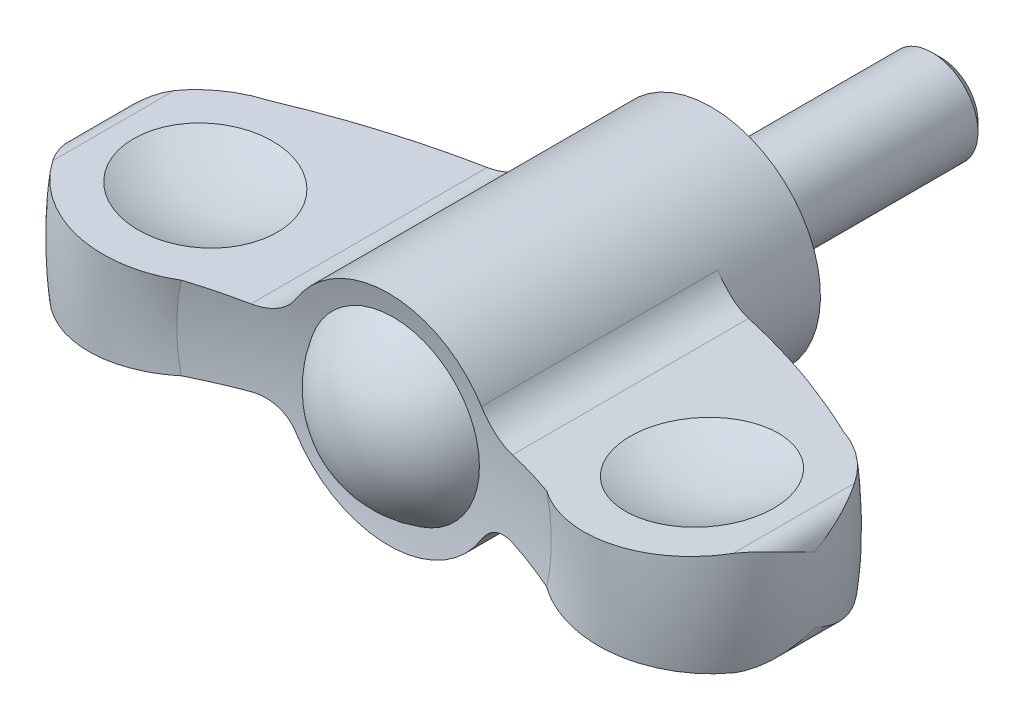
ISO-10303-21;
HEADER;
FILE_DESCRIPTION(('STEP AP214'),'2;1');
FILE_NAME('part.step','',(''),(''),'','','');
FILE_SCHEMA(('AUTOMOTIVE_DESIGN { 1 0 10303 214 1 1 1 1 }'));
ENDSEC;
DATA;
#1=APPLICATION_CONTEXT('core data for automotive mechanical design processes');
#2=APPLICATION_PROTOCOL_DEFINITION('international standard','automotive_design',2000,#1);
#3=PRODUCT_CONTEXT('',#1,'mechanical');
#4=PRODUCT('Part','Part','',(#3));
#5=PRODUCT_RELATED_PRODUCT_CATEGORY('part','',(#4));
#6=PRODUCT_DEFINITION_FORMATION('','',#4);
#7=PRODUCT_DEFINITION_CONTEXT('part definition',#1,'design');
#8=PRODUCT_DEFINITION('design','',#6,#7);
#9=PRODUCT_DEFINITION_SHAPE('','',#8);
#10=(LENGTH_UNIT() NAMED_UNIT(*) SI_UNIT(.MILLI.,.METRE.));
#11=(NAMED_UNIT(*) PLANE_ANGLE_UNIT() SI_UNIT($,.RADIAN.));
#12=(NAMED_UNIT(*) SI_UNIT($,.STERADIAN.) SOLID_ANGLE_UNIT());
#13=UNCERTAINTY_MEASURE_WITH_UNIT(LENGTH_MEASURE(1.E-05),#10,'distance_accuracy_value','');
#14=(GEOMETRIC_REPRESENTATION_CONTEXT(3) GLOBAL_UNCERTAINTY_ASSIGNED_CONTEXT((#13)) GLOBAL_UNIT_ASSIGNED_CONTEXT((#10,
#11,#12)) REPRESENTATION_CONTEXT('',''));
#15=CARTESIAN_POINT('',(0.,0.,0.));
#16=DIRECTION('',(0.,0.,1.));
#17=DIRECTION('',(1.,0.,0.));
#18=AXIS2_PLACEMENT_3D('',#15,#16,#17);
#19=CARTESIAN_POINT('',(0.,0.,76.6132216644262));
#20=DIRECTION('',(0.,0.,1.));
#21=DIRECTION('',(0.,1.,0.));
#22=AXIS2_PLACEMENT_3D('',#19,#20,#21);
#23=DEGENERATE_TOROIDAL_SURFACE('',#22,7.41274216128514,71.1525000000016,.F.);
#24=CARTESIAN_POINT('',(0.,0.,7.5));
#25=DIRECTION('',(0.,0.,1.));
#26=DIRECTION('',(0.,1.,0.));
#27=AXIS2_PLACEMENT_3D('',#24,#25,#26);
#28=CIRCLE('',#27,9.5);
#29=CARTESIAN_POINT('',(8.07537706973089,-5.00382705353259,7.5));
#30=VERTEX_POINT('',#29);
#31=CARTESIAN_POINT('',(8.07537711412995,5.0038269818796,7.5));
#32=VERTEX_POINT('',#31);
#33=EDGE_CURVE('E157',#30,#32,#28,.T.);
#34=ORIENTED_EDGE('',*,*,#33,.T.);
#35=CARTESIAN_POINT('',(8.07525319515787,5.00402698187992,7.50000000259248));
#36=CARTESIAN_POINT('',(8.12665454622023,4.92103773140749,7.49999174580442));
#37=CARTESIAN_POINT('',(8.18144861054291,4.84015820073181,7.50133541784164));
#38=CARTESIAN_POINT('',(8.29736182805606,4.68318005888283,7.50668034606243));
#39=CARTESIAN_POINT('',(8.35847989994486,4.607080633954,7.51068114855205));
#40=CARTESIAN_POINT('',(8.48644181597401,4.46037528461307,7.52128110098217));
#41=CARTESIAN_POINT('',(8.55327127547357,4.38975636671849,7.52787386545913));
#42=CARTESIAN_POINT('',(8.69224302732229,4.25429556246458,7.54356393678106));
#43=CARTESIAN_POINT('',(8.76438537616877,4.18945373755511,7.55266127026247));
#44=CARTESIAN_POINT('',(8.98795756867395,4.00427129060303,7.58354719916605));
#45=CARTESIAN_POINT('',(9.14667405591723,3.89311211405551,7.60894168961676));
#46=CARTESIAN_POINT('',(9.4786404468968,3.69815734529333,7.66816076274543));
#47=CARTESIAN_POINT('',(9.65189888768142,3.61437796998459,7.70199032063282));
#48=CARTESIAN_POINT('',(10.0125625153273,3.47403571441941,7.77763329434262));
#49=CARTESIAN_POINT('',(10.2002114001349,3.41819606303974,7.8196232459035));
#50=CARTESIAN_POINT('',(10.5805892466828,3.33774343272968,7.90948197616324));
#51=CARTESIAN_POINT('',(10.7733131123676,3.31310026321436,7.95734502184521));
#52=CARTESIAN_POINT('',(11.033653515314,3.30081513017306,8.02491673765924));
#53=CARTESIAN_POINT('',(11.1013248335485,3.29954054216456,8.04274730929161));
#54=CARTESIAN_POINT('',(11.236373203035,3.30079631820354,8.07885369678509));
#55=CARTESIAN_POINT('',(11.3037505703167,3.30331932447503,8.09712858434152));
#56=CARTESIAN_POINT('',(11.3709729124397,3.30772213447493,8.11561851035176));
#57=B_SPLINE_CURVE_WITH_KNOTS('',3,(#35,#36,#37,#38,#39,#40,#41,#42,#43,#44,#45,#46,#47,#48,#49,
#50,#51,#52,#53,#54,#55,#56),.UNSPECIFIED.,.F.,.F.,(4,2,2,2,2,2,2,2,2,2,4),(0.,
0.292752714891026,0.585455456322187,0.87744157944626,1.16943080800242,1.75277206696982,
2.33645821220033,2.93455895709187,3.53208044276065,3.74198071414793,3.95147483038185),.UNSPECIFIED.);
#58=CARTESIAN_POINT('',(11.3707729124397,3.30770903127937,8.11556349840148));
#59=VERTEX_POINT('',#58);
#60=EDGE_CURVE('E251',#32,#59,#57,.T.);
#61=ORIENTED_EDGE('',*,*,#60,.T.);
#62=CARTESIAN_POINT('',(24.9191403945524,4.19496480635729,13.4109144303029));
#63=CARTESIAN_POINT('',(23.8381391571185,4.12417217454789,12.8535823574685));
#64=CARTESIAN_POINT('',(22.7428134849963,4.05244146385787,12.324205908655));
#65=CARTESIAN_POINT('',(20.5293345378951,3.90748510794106,11.3241128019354));
#66=CARTESIAN_POINT('',(19.4112500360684,3.83426396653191,10.8532432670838));
#67=CARTESIAN_POINT('',(17.1522467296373,3.68632631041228,9.96991193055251));
#68=CARTESIAN_POINT('',(16.0113274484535,3.61160976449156,9.55745134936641));
#69=CARTESIAN_POINT('',(14.2836536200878,3.49846782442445,8.98318373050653));
#70=CARTESIAN_POINT('',(13.7042390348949,3.46052310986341,8.79894257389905));
#71=CARTESIAN_POINT('',(12.5407906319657,3.38433117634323,8.44572577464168));
#72=CARTESIAN_POINT('',(11.956756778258,3.34608395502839,8.27675025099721));
#73=CARTESIAN_POINT('',(11.3705729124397,3.30769593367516,8.11550848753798));
#74=B_SPLINE_CURVE_WITH_KNOTS('',3,(#62,#63,#64,#65,#66,#67,#68,#69,#70,#71,#72,#73),
.UNSPECIFIED.,.F.,.F.,(4,2,2,2,2,4),(0.,3.65437061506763,7.29898215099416,10.9436698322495,
12.771042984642,14.5984303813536),.UNSPECIFIED.);
#75=CARTESIAN_POINT('',(24.9187524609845,4.19493940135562,13.4107144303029));
#76=VERTEX_POINT('',#75);
#77=EDGE_CURVE('E242',#76,#59,#74,.T.);
#78=ORIENTED_EDGE('',*,*,#77,.F.);
#79=CARTESIAN_POINT('',(0.,0.,13.4107144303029));
#80=DIRECTION('',(0.,0.,1.));
#81=DIRECTION('',(0.,1.,0.));
#82=AXIS2_PLACEMENT_3D('',#79,#80,#81);
#83=CIRCLE('',#82,25.2693834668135);
#84=CARTESIAN_POINT('',(24.9187524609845,-4.19493940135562,13.4107144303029));
#85=VERTEX_POINT('',#84);
#86=EDGE_CURVE('E402',#85,#76,#83,.T.);
#87=ORIENTED_EDGE('',*,*,#86,.F.);
#88=CARTESIAN_POINT('',(11.3705729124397,-3.30769593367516,8.11550848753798));
#89=CARTESIAN_POINT('',(13.3194357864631,-3.43532310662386,8.65165350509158));
#90=CARTESIAN_POINT('',(15.2454387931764,-3.56145323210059,9.27335320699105));
#91=CARTESIAN_POINT('',(19.0285581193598,-3.80920223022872,10.6774595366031));
#92=CARTESIAN_POINT('',(20.8859409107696,-3.93083855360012,11.4591449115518));
#93=CARTESIAN_POINT('',(23.0778618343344,-4.07438311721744,12.4939591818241));
#94=CARTESIAN_POINT('',(23.4481408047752,-4.09863195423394,12.6727423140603));
#95=CARTESIAN_POINT('',(24.1858660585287,-4.14694412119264,13.0369148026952));
#96=CARTESIAN_POINT('',(24.5533094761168,-4.1710072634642,13.2223099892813));
#97=CARTESIAN_POINT('',(24.9191403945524,-4.19496480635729,13.4109144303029));
#98=B_SPLINE_CURVE_WITH_KNOTS('',3,(#88,#89,#90,#91,#92,#93,#94,#95,#96,#97),.UNSPECIFIED.,.F.,
.F.,(4,2,2,2,4),(0.,6.07517314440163,12.1235385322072,13.3591937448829,14.5959668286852),.UNSPECIFIED.);
#99=CARTESIAN_POINT('',(11.3707729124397,-3.30770903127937,8.11556349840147));
#100=VERTEX_POINT('',#99);
#101=EDGE_CURVE('E232',#100,#85,#98,.T.);
#102=ORIENTED_EDGE('',*,*,#101,.F.);
#103=CARTESIAN_POINT('',(11.3709729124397,-3.30772213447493,8.11561851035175));
#104=CARTESIAN_POINT('',(11.2701325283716,-3.30110509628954,8.08788118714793));
#105=CARTESIAN_POINT('',(11.1688817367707,-3.29874082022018,8.06061250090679));
#106=CARTESIAN_POINT('',(10.9662236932,-3.3025707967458,8.00721735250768));
#107=CARTESIAN_POINT('',(10.86481641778,-3.30876648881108,7.98109108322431));
#108=CARTESIAN_POINT('',(10.6624409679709,-3.32978238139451,7.93016922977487));
#109=CARTESIAN_POINT('',(10.5614733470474,-3.34461137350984,7.90537503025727));
#110=CARTESIAN_POINT('',(10.3608328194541,-3.38287019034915,7.85737208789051));
#111=CARTESIAN_POINT('',(10.2611598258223,-3.40629943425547,7.83416323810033));
#112=CARTESIAN_POINT('',(9.96486870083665,-3.48949811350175,7.76717843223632));
#113=CARTESIAN_POINT('',(9.77109378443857,-3.56216663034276,7.72607333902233));
#114=CARTESIAN_POINT('',(9.39755022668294,-3.74054378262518,7.65286990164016));
#115=CARTESIAN_POINT('',(9.21777675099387,-3.84624095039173,7.62076843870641));
#116=CARTESIAN_POINT('',(8.96611052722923,-4.02532517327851,7.58103605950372));
#117=CARTESIAN_POINT('',(8.88646307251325,-4.08719630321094,7.56933067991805));
#118=CARTESIAN_POINT('',(8.73245596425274,-4.21758210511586,7.54853793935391));
#119=CARTESIAN_POINT('',(8.65809406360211,-4.28609392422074,7.53944946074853));
#120=CARTESIAN_POINT('',(8.51538277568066,-4.42916784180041,7.52402786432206));
#121=CARTESIAN_POINT('',(8.44702397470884,-4.50372010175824,7.51769036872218));
#122=CARTESIAN_POINT('',(8.31677244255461,-4.65839173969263,7.50784180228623));
#123=CARTESIAN_POINT('',(8.25487550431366,-4.73850743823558,7.50432888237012));
#124=CARTESIAN_POINT('',(8.1753277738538,-4.85096452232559,7.50150027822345));
#125=CARTESIAN_POINT('',(8.15464683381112,-4.88116885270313,7.50093670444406));
#126=CARTESIAN_POINT('',(8.11423881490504,-4.94215928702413,7.50018643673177));
#127=CARTESIAN_POINT('',(8.09451057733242,-4.97294461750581,7.49999927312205));
#128=CARTESIAN_POINT('',(8.07525315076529,-5.00402705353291,7.50000000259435));
#129=B_SPLINE_CURVE_WITH_KNOTS('',3,(#103,#104,#105,#106,#107,#108,#109,#110,#111,#112,#113,
#114,#115,#116,#117,#118,#119,#120,#121,#122,#123,#124,#125,#126,#127,#128),.UNSPECIFIED.,.F.,
.F.,(4,2,2,2,2,2,2,2,2,2,2,2,4),(0.,0.314298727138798,0.628650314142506,0.943322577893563,
1.25797359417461,1.88762970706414,2.51706744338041,2.82134305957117,3.12548853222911,
3.42914821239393,3.73260894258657,3.8424257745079,3.95210549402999),.UNSPECIFIED.);
#130=EDGE_CURVE('E222',#100,#30,#129,.T.);
#131=ORIENTED_EDGE('',*,*,#130,.T.);
#132=EDGE_LOOP('',(#34,#61,#78,#87,#102,#131));
#133=FACE_BOUND('',#132,.T.);
#134=ADVANCED_FACE('F14',(#133),#23,.F.);
#135=CARTESIAN_POINT('',(0.,0.,22.4));
#136=DIRECTION('',(0.,0.,1.));
#137=DIRECTION('',(0.,1.,0.));
#138=AXIS2_PLACEMENT_3D('',#135,#136,#137);
#139=TOROIDAL_SURFACE('',#138,21.9,9.6);
#140=CARTESIAN_POINT('',(-18.1474454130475,-3.75149990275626,13.4105144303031));
#141=CARTESIAN_POINT('',(-17.8905850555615,-3.73467862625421,13.5060281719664));
#142=CARTESIAN_POINT('',(-17.6377608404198,-3.71812166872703,13.6124268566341));
#143=CARTESIAN_POINT('',(-17.1419285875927,-3.68565059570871,13.8461211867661));
#144=CARTESIAN_POINT('',(-16.8989202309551,-3.66973645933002,13.9734161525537));
#145=CARTESIAN_POINT('',(-16.4245099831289,-3.63866827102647,14.2479997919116));
#146=CARTESIAN_POINT('',(-16.1931050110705,-3.62351401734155,14.3952831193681));
#147=CARTESIAN_POINT('',(-15.743480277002,-3.59406898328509,14.7088327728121));
#148=CARTESIAN_POINT('',(-15.5252603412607,-3.57977819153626,14.8750988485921));
#149=CARTESIAN_POINT('',(-15.1034606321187,-3.55215536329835,15.2255617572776));
#150=CARTESIAN_POINT('',(-14.8998888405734,-3.53882384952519,15.4097682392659));
#151=CARTESIAN_POINT('',(-14.5090032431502,-3.51322552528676,15.794766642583));
#152=CARTESIAN_POINT('',(-14.321689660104,-3.50095872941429,15.9955587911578));
#153=CARTESIAN_POINT('',(-13.9647725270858,-3.4775849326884,16.4122828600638));
#154=CARTESIAN_POINT('',(-13.7951642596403,-3.46647762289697,16.6282107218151));
#155=CARTESIAN_POINT('',(-13.4749045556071,-3.44550444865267,17.073751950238));
#156=CARTESIAN_POINT('',(-13.3242529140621,-3.43563857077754,17.3033651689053));
#157=CARTESIAN_POINT('',(-13.0439598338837,-3.41728273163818,17.7732237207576));
#158=CARTESIAN_POINT('',(-12.9141954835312,-3.40878472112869,18.0133954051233));
#159=CARTESIAN_POINT('',(-12.6756273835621,-3.39316136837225,18.5039680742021));
#160=CARTESIAN_POINT('',(-12.5668227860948,-3.38603597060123,18.7543686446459));
#161=CARTESIAN_POINT('',(-12.3710778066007,-3.37321701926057,19.2636307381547));
#162=CARTESIAN_POINT('',(-12.2841387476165,-3.36752355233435,19.5224927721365));
#163=CARTESIAN_POINT('',(-12.1328924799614,-3.35761873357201,20.0467739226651));
#164=CARTESIAN_POINT('',(-12.0685848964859,-3.35340735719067,20.3121929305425));
#165=CARTESIAN_POINT('',(-11.9641647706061,-3.34656908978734,20.842606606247));
#166=CARTESIAN_POINT('',(-11.9236219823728,-3.34391402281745,21.1075162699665));
#167=CARTESIAN_POINT('',(-11.8652424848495,-3.34009086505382,21.6398358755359));
#168=CARTESIAN_POINT('',(-11.8474054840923,-3.33892275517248,21.9072457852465));
#169=CARTESIAN_POINT('',(-11.8345982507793,-3.33808403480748,22.4425774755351));
#170=CARTESIAN_POINT('',(-11.8396248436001,-3.33841321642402,22.7104991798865));
#171=CARTESIAN_POINT('',(-11.8724923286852,-3.34056564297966,23.2449323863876));
#172=CARTESIAN_POINT('',(-11.9003331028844,-3.34238888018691,23.5114438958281));
#173=CARTESIAN_POINT('',(-11.9780680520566,-3.34747958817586,24.0376567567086));
#174=CARTESIAN_POINT('',(-12.027669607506,-3.35072789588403,24.2974015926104));
#175=CARTESIAN_POINT('',(-12.1484267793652,-3.35863604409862,24.811805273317));
#176=CARTESIAN_POINT('',(-12.2195821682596,-3.36329586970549,25.0664641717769));
#177=CARTESIAN_POINT('',(-12.3828443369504,-3.37398758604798,25.5689078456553));
#178=CARTESIAN_POINT('',(-12.4749485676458,-3.38001930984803,25.8166934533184));
#179=CARTESIAN_POINT('',(-12.679407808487,-3.39340894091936,26.3038316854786));
#180=CARTESIAN_POINT('',(-12.7917703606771,-3.40076734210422,26.543181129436));
#181=CARTESIAN_POINT('',(-13.0369078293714,-3.41682090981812,27.0137884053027));
#182=CARTESIAN_POINT('',(-13.1698514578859,-3.42552712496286,27.2449579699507));
#183=CARTESIAN_POINT('',(-13.4544154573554,-3.44416265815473,27.6954567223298));
#184=CARTESIAN_POINT('',(-13.6060365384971,-3.45409202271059,27.9147854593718));
#185=CARTESIAN_POINT('',(-13.9268367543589,-3.47510059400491,28.3401572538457));
#186=CARTESIAN_POINT('',(-14.0960166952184,-3.48617985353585,28.5461997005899));
#187=CARTESIAN_POINT('',(-14.4507138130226,-3.50940826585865,28.9436423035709));
#188=CARTESIAN_POINT('',(-14.6362312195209,-3.52155743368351,29.1350422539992));
#189=CARTESIAN_POINT('',(-15.0260268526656,-3.54708437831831,29.5054914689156));
#190=CARTESIAN_POINT('',(-15.2305978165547,-3.56048132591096,29.6842314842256));
#191=CARTESIAN_POINT('',(-15.6538967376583,-3.58820233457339,30.0239900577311));
#192=CARTESIAN_POINT('',(-15.8726245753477,-3.6025263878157,30.1850087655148));
#193=CARTESIAN_POINT('',(-16.322752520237,-3.63200437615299,30.4882695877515));
#194=CARTESIAN_POINT('',(-16.5541555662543,-3.6471585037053,30.6305073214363));
#195=CARTESIAN_POINT('',(-17.0278914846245,-3.67818253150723,30.8951425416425));
#196=CARTESIAN_POINT('',(-17.2702206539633,-3.69405218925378,31.017546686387));
#197=CARTESIAN_POINT('',(-17.7669669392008,-3.72658312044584,31.2429802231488));
#198=CARTESIAN_POINT('',(-18.0214889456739,-3.74325126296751,31.3457775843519));
#199=CARTESIAN_POINT('',(-18.538265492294,-3.77709393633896,31.5295393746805));
#200=CARTESIAN_POINT('',(-18.8005200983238,-3.79426847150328,31.6105036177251));
#201=CARTESIAN_POINT('',(-19.3309113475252,-3.82900274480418,31.7500060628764));
#202=CARTESIAN_POINT('',(-19.5990481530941,-3.84656249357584,31.8085436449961));
#203=CARTESIAN_POINT('',(-20.1392890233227,-3.88194179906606,31.9027453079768));
#204=CARTESIAN_POINT('',(-20.4113930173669,-3.89976135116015,31.9384097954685));
#205=CARTESIAN_POINT('',(-20.9576381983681,-3.93553386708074,31.9865808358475));
#206=CARTESIAN_POINT('',(-21.2317794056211,-3.95348683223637,31.9990871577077));
#207=CARTESIAN_POINT('',(-21.7801364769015,-3.98939765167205,32.0008164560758));
#208=CARTESIAN_POINT('',(-22.0543523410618,-4.00735550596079,31.9900393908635));
#209=CARTESIAN_POINT('',(-22.6008596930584,-4.04314519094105,31.9452447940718));
#210=CARTESIAN_POINT('',(-22.8731513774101,-4.06097703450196,31.9112296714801));
#211=CARTESIAN_POINT('',(-23.4138724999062,-4.09638779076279,31.8201695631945));
#212=CARTESIAN_POINT('',(-23.6823019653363,-4.1139667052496,31.7631247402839));
#213=CARTESIAN_POINT('',(-24.2118784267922,-4.14864761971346,31.6267614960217));
#214=CARTESIAN_POINT('',(-24.4730575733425,-4.16575172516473,31.547568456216));
#215=CARTESIAN_POINT('',(-24.987795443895,-4.19946088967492,31.3673123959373));
#216=CARTESIAN_POINT('',(-25.2413540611,-4.2160659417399,31.2662490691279));
#217=CARTESIAN_POINT('',(-25.7391278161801,-4.24866415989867,31.0428965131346));
#218=CARTESIAN_POINT('',(-25.9833385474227,-4.26465703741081,30.9205974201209));
#219=CARTESIAN_POINT('',(-26.4605066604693,-4.29590583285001,30.655664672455));
#220=CARTESIAN_POINT('',(-26.6934645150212,-4.31116178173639,30.5130318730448));
#221=CARTESIAN_POINT('',(-27.1452633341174,-4.34074919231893,30.2092249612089));
#222=CARTESIAN_POINT('',(-27.3641711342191,-4.35508503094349,30.0481506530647));
#223=CARTESIAN_POINT('',(-27.7875859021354,-4.38281362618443,29.7080080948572));
#224=CARTESIAN_POINT('',(-27.9920934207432,-4.39620641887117,29.5289405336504));
#225=CARTESIAN_POINT('',(-28.3848624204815,-4.42192808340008,29.1544313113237));
#226=CARTESIAN_POINT('',(-28.5731528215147,-4.43425884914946,28.9590200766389));
#227=CARTESIAN_POINT('',(-28.9324617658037,-4.45778928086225,28.5530043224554));
#228=CARTESIAN_POINT('',(-29.1034908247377,-4.4689896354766,28.3424091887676));
#229=CARTESIAN_POINT('',(-29.319374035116,-4.48312739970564,28.0522910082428));
#230=CARTESIAN_POINT('',(-29.3724491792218,-4.48660318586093,27.9788119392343));
#231=CARTESIAN_POINT('',(-29.4764415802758,-4.49341344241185,27.8304567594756));
#232=CARTESIAN_POINT('',(-29.5273611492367,-4.49674806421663,27.7555822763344));
#233=CARTESIAN_POINT('',(-29.5772181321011,-4.50001309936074,27.679991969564));
#234=B_SPLINE_CURVE_WITH_KNOTS('',3,(#140,#141,#142,#143,#144,#145,#146,#147,#148,#149,#150,
#151,#152,#153,#154,#155,#156,#157,#158,#159,#160,#161,#162,#163,#164,#165,#166,#167,#168,#169,
#170,#171,#172,#173,#174,#175,#176,#177,#178,#179,#180,#181,#182,#183,#184,#185,#186,#187,#188,
#189,#190,#191,#192,#193,#194,#195,#196,#197,#198,#199,#200,#201,#202,#203,#204,#205,#206,#207,
#208,#209,#210,#211,#212,#213,#214,#215,#216,#217,#218,#219,#220,#221,#222,#223,#224,#225,#226,
#227,#228,#229,#230,#231,#232,#233),.UNSPECIFIED.,.F.,.F.,(4,2,2,2,2,2,2,2,2,2,2,2,2,2,2,2,2,2,
2,2,2,2,2,2,2,2,2,2,2,2,2,2,2,2,2,2,2,2,2,2,2,2,2,2,2,2,4),(0.,0.82342903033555,
1.64683128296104,2.47001373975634,3.29318534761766,4.11680216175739,4.9404302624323,
5.76383834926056,6.58723753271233,7.40559872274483,8.22392680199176,9.04230438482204,
9.86066841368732,10.6637182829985,11.4667578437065,12.2696859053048,13.0726098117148,
13.8650526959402,14.6574872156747,15.449825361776,16.2424591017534,17.0419728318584,
17.8415169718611,18.6410978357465,19.4406899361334,20.2556974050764,21.0706979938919,
21.8858883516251,22.7008044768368,23.5248358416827,24.3488742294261,25.1729353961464,
25.9969819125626,26.8210366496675,27.6450928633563,28.469063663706,29.2930286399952,
30.1124203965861,30.9318236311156,31.7516084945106,32.5713588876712,33.3868657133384,
34.2023413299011,35.0163312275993,35.8298222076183,36.1019244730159,36.3737270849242),.UNSPECIFIED.);
#235=CARTESIAN_POINT('',(-15.8916566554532,-3.60377276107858,30.1939503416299));
#236=VERTEX_POINT('',#235);
#237=CARTESIAN_POINT('',(-29.5770181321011,-4.5,27.6802951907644));
#238=VERTEX_POINT('',#237);
#239=EDGE_CURVE('E276',#236,#238,#234,.T.);
#240=ORIENTED_EDGE('',*,*,#239,.F.);
#241=CARTESIAN_POINT('',(0.,0.,30.1939503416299));
#242=DIRECTION('',(0.,0.,1.));
#243=DIRECTION('',(0.,1.,0.));
#244=AXIS2_PLACEMENT_3D('',#241,#242,#243);
#245=CIRCLE('',#244,16.2951504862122);
#246=CARTESIAN_POINT('',(-15.8916566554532,3.60377276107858,30.1939503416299));
#247=VERTEX_POINT('',#246);
#248=EDGE_CURVE('E210',#247,#236,#245,.T.);
#249=ORIENTED_EDGE('',*,*,#248,.F.);
#250=CARTESIAN_POINT('',(-29.577218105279,4.50001309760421,27.6799920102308));
#251=CARTESIAN_POINT('',(-29.4283813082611,4.49026607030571,27.9057071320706));
#252=CARTESIAN_POINT('',(-29.2699701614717,4.47989203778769,28.1250732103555));
#253=CARTESIAN_POINT('',(-28.9352574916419,4.45797236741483,28.5496181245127));
#254=CARTESIAN_POINT('',(-28.7589571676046,4.44642680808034,28.7547979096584));
#255=CARTESIAN_POINT('',(-28.3898682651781,4.42225590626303,29.1493363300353));
#256=CARTESIAN_POINT('',(-28.1970944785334,4.40963153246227,29.3387088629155));
#257=CARTESIAN_POINT('',(-27.7963194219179,4.38338556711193,29.7005094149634));
#258=CARTESIAN_POINT('',(-27.5883182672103,4.3697639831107,29.872937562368));
#259=CARTESIAN_POINT('',(-27.1584989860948,4.34161596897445,30.199703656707));
#260=CARTESIAN_POINT('',(-26.9366758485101,4.32708921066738,30.3540349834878));
#261=CARTESIAN_POINT('',(-26.4808650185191,4.29723906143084,30.6434656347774));
#262=CARTESIAN_POINT('',(-26.2468771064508,4.28191565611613,30.7785646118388));
#263=CARTESIAN_POINT('',(-25.7684462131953,4.25058416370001,31.0285776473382));
#264=CARTESIAN_POINT('',(-25.5240048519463,4.23457618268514,31.1434948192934));
#265=CARTESIAN_POINT('',(-25.0263706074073,4.20198710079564,31.3523874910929));
#266=CARTESIAN_POINT('',(-24.773177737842,4.1854060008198,31.4463630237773));
#267=CARTESIAN_POINT('',(-24.2590478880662,4.15173665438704,31.6129966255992));
#268=CARTESIAN_POINT('',(-23.9980896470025,4.13464701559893,31.685588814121));
#269=CARTESIAN_POINT('',(-23.4709078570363,4.10012292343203,31.8086173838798));
#270=CARTESIAN_POINT('',(-23.2046821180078,4.08268832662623,31.8590443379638));
#271=CARTESIAN_POINT('',(-22.6689091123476,4.04760161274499,31.9373839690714));
#272=CARTESIAN_POINT('',(-22.3993613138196,4.0299494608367,31.9652929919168));
#273=CARTESIAN_POINT('',(-21.8589964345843,3.99456203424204,31.9984159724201));
#274=CARTESIAN_POINT('',(-21.5881799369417,3.97682679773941,32.0036394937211));
#275=CARTESIAN_POINT('',(-21.0454404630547,3.94128386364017,31.9913795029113));
#276=CARTESIAN_POINT('',(-20.7735205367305,3.9234763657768,31.9737602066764));
#277=CARTESIAN_POINT('',(-20.2321124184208,3.88802061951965,31.9157373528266));
#278=CARTESIAN_POINT('',(-19.9626242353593,3.8703723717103,31.8753337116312));
#279=CARTESIAN_POINT('',(-19.4280257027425,3.83536257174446,31.7720671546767));
#280=CARTESIAN_POINT('',(-19.1629144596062,3.81800096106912,31.7092088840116));
#281=CARTESIAN_POINT('',(-18.6387730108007,3.78367597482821,31.5614710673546));
#282=CARTESIAN_POINT('',(-18.3797450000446,3.76671274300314,31.4765837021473));
#283=CARTESIAN_POINT('',(-17.8682212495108,3.73321406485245,31.2848646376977));
#284=CARTESIAN_POINT('',(-17.6157711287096,3.71668160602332,31.177910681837));
#285=CARTESIAN_POINT('',(-17.1207307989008,3.6842623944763,30.9431230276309));
#286=CARTESIAN_POINT('',(-16.8781406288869,3.66837564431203,30.8152892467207));
#287=CARTESIAN_POINT('',(-16.4045275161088,3.63735965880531,30.5396362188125));
#288=CARTESIAN_POINT('',(-16.1735051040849,3.62223045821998,30.3918160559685));
#289=CARTESIAN_POINT('',(-15.7246794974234,3.59283775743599,30.0772205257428));
#290=CARTESIAN_POINT('',(-15.5068766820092,3.57857428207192,29.9104446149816));
#291=CARTESIAN_POINT('',(-15.0856203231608,3.55098703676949,29.5587225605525));
#292=CARTESIAN_POINT('',(-14.8821981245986,3.53766531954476,29.3737387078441));
#293=CARTESIAN_POINT('',(-14.4917116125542,3.51209313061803,28.9871837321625));
#294=CARTESIAN_POINT('',(-14.3046468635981,3.49984263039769,28.7856130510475));
#295=CARTESIAN_POINT('',(-13.9482722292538,3.47650436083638,28.3672761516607));
#296=CARTESIAN_POINT('',(-13.7789624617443,3.46541659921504,28.1505098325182));
#297=CARTESIAN_POINT('',(-13.4594078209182,3.4444895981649,27.7032976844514));
#298=CARTESIAN_POINT('',(-13.3091625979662,3.43465033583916,27.4728521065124));
#299=CARTESIAN_POINT('',(-13.0300075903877,3.4163690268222,27.0017206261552));
#300=CARTESIAN_POINT('',(-12.9009427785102,3.40791682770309,26.7611269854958));
#301=CARTESIAN_POINT('',(-12.6638563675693,3.39239050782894,26.269856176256));
#302=CARTESIAN_POINT('',(-12.5558264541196,3.38531584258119,26.0191830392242));
#303=CARTESIAN_POINT('',(-12.3616487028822,3.37259952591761,25.5094385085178));
#304=CARTESIAN_POINT('',(-12.2755026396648,3.36695799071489,25.2503664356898));
#305=CARTESIAN_POINT('',(-12.125856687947,3.35715797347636,24.7257346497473));
#306=CARTESIAN_POINT('',(-12.0623564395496,3.35299946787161,24.4601750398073));
#307=CARTESIAN_POINT('',(-11.9595441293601,3.34626649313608,23.9295575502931));
#308=CARTESIAN_POINT('',(-11.9198013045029,3.34366381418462,23.6645834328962));
#309=CARTESIAN_POINT('',(-11.8630211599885,3.33994539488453,23.1322038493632));
#310=CARTESIAN_POINT('',(-11.8459835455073,3.33882963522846,22.8647984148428));
#311=CARTESIAN_POINT('',(-11.8347668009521,3.33809507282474,22.3295252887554));
#312=CARTESIAN_POINT('',(-11.8405860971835,3.33847616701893,22.0616576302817));
#313=CARTESIAN_POINT('',(-11.8750272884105,3.34073165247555,21.5273997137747));
#314=CARTESIAN_POINT('',(-11.9036490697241,3.34260603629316,21.2610094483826));
#315=CARTESIAN_POINT('',(-11.9829240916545,3.34779760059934,20.7350583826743));
#316=CARTESIAN_POINT('',(-12.033288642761,3.35109587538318,20.4754538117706));
#317=CARTESIAN_POINT('',(-12.1555550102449,3.35910285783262,19.961393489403));
#318=CARTESIAN_POINT('',(-12.2274566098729,3.36381155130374,19.7069376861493));
#319=CARTESIAN_POINT('',(-12.3921774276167,3.37459879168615,19.2049950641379));
#320=CARTESIAN_POINT('',(-12.4849912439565,3.38067698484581,18.9575064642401));
#321=CARTESIAN_POINT('',(-12.6908448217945,3.39415792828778,18.470999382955));
#322=CARTESIAN_POINT('',(-12.8038936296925,3.40156127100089,18.2319847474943));
#323=CARTESIAN_POINT('',(-13.050399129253,3.41770442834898,17.7620583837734));
#324=CARTESIAN_POINT('',(-13.1840279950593,3.42645551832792,17.5312373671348));
#325=CARTESIAN_POINT('',(-13.4698675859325,3.4451745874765,17.0815911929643));
#326=CARTESIAN_POINT('',(-13.6220707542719,3.45514207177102,16.8627612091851));
#327=CARTESIAN_POINT('',(-13.9440945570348,3.4762307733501,16.4382825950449));
#328=CARTESIAN_POINT('',(-14.113927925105,3.48735282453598,16.2326436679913));
#329=CARTESIAN_POINT('',(-14.4698944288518,3.51066436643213,15.836072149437));
#330=CARTESIAN_POINT('',(-14.6560271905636,3.52285383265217,15.6451392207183));
#331=CARTESIAN_POINT('',(-15.0471805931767,3.54846969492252,15.2755429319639));
#332=CARTESIAN_POINT('',(-15.2525053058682,3.56191600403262,15.097202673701));
#333=CARTESIAN_POINT('',(-15.6772923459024,3.58973446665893,14.7583242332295));
#334=CARTESIAN_POINT('',(-15.8967545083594,3.60410660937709,14.5977858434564));
#335=CARTESIAN_POINT('',(-16.3478939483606,3.63365083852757,14.2958496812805));
#336=CARTESIAN_POINT('',(-16.5795509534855,3.64882159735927,14.1544214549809));
#337=CARTESIAN_POINT('',(-17.0537037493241,3.67987292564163,13.8914238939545));
#338=CARTESIAN_POINT('',(-17.2961933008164,3.69575308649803,13.769843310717));
#339=CARTESIAN_POINT('',(-17.6425873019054,3.71843774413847,13.6138611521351));
#340=CARTESIAN_POINT('',(-17.7426773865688,3.7249924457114,13.5707938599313));
#341=CARTESIAN_POINT('',(-17.9441132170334,3.7381840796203,13.4880908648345));
#342=CARTESIAN_POINT('',(-18.045457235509,3.74482089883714,13.4484509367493));
#343=CARTESIAN_POINT('',(-18.1474454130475,3.75149990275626,13.4105144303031));
#344=B_SPLINE_CURVE_WITH_KNOTS('',3,(#250,#251,#252,#253,#254,#255,#256,#257,#258,#259,#260,
#261,#262,#263,#264,#265,#266,#267,#268,#269,#270,#271,#272,#273,#274,#275,#276,#277,#278,#279,
#280,#281,#282,#283,#284,#285,#286,#287,#288,#289,#290,#291,#292,#293,#294,#295,#296,#297,#298,
#299,#300,#301,#302,#303,#304,#305,#306,#307,#308,#309,#310,#311,#312,#313,#314,#315,#316,#317,
#318,#319,#320,#321,#322,#323,#324,#325,#326,#327,#328,#329,#330,#331,#332,#333,#334,#335,#336,
#337,#338,#339,#340,#341,#342,#343),.UNSPECIFIED.,.F.,.F.,(4,2,2,2,2,2,2,2,2,2,2,2,2,2,2,2,2,2,
2,2,2,2,2,2,2,2,2,2,2,2,2,2,2,2,2,2,2,2,2,2,2,2,2,2,2,2,4),(0.,0.811383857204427,
1.62271336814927,2.43332187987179,3.24392425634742,4.05482224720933,4.86573488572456,
5.67652231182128,6.48730846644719,7.30056707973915,8.11417124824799,8.92790742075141,
9.7413005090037,10.5595508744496,11.3778042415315,12.1958884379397,13.0142634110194,
13.8373004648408,14.6603407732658,15.4834188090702,16.3065204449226,17.1313641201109,
17.9561858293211,18.7810130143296,19.6058250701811,20.4243011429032,21.2424530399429,
22.0606712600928,22.8788764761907,23.6817568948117,24.4846268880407,25.2874416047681,
26.0902523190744,26.8827166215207,27.6751729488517,28.4674248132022,29.2600317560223,
30.0596712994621,30.8589865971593,31.658883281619,32.4587616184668,33.2746912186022,
34.090611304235,34.9052154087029,35.7193562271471,36.0467859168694,36.3738060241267),.UNSPECIFIED.);
#345=CARTESIAN_POINT('',(-29.577018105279,4.5,27.6802952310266));
#346=VERTEX_POINT('',#345);
#347=EDGE_CURVE('E298',#346,#247,#344,.T.);
#348=ORIENTED_EDGE('',*,*,#347,.F.);
#349=CARTESIAN_POINT('',(-31.369564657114,2.86363636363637,22.4));
#350=CARTESIAN_POINT('',(-31.3693228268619,2.86628559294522,22.4059654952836));
#351=CARTESIAN_POINT('',(-31.3690751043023,2.86893438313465,22.4119311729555));
#352=CARTESIAN_POINT('',(-31.3455550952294,3.11453943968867,22.9652019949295));
#353=CARTESIAN_POINT('',(-31.2727100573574,3.35362322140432,23.5139845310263));
#354=CARTESIAN_POINT('',(-31.0906514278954,3.68216340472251,24.3317563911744));
#355=CARTESIAN_POINT('',(-31.0177760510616,3.78670945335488,24.6035877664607));
#356=CARTESIAN_POINT('',(-30.8477677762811,3.98135441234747,25.1449637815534));
#357=CARTESIAN_POINT('',(-30.7506472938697,4.07146067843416,25.4145095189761));
#358=CARTESIAN_POINT('',(-30.5719332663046,4.20252900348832,25.8529322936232));
#359=CARTESIAN_POINT('',(-30.4974342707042,4.24947683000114,26.0229493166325));
#360=CARTESIAN_POINT('',(-30.3388744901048,4.33328283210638,26.3608778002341));
#361=CARTESIAN_POINT('',(-30.2548212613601,4.37014890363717,26.5287908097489));
#362=CARTESIAN_POINT('',(-30.0769796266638,4.43174329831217,26.8627513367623));
#363=CARTESIAN_POINT('',(-29.9831491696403,4.45641633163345,27.0287870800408));
#364=CARTESIAN_POINT('',(-29.8357178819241,4.48201227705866,27.2752518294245));
#365=CARTESIAN_POINT('',(-29.7853951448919,4.48864307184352,27.3570723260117));
#366=CARTESIAN_POINT('',(-29.6826484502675,4.4976362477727,27.5196657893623));
#367=CARTESIAN_POINT('',(-29.630223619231,4.49999683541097,27.6004383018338));
#368=CARTESIAN_POINT('',(-29.5768181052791,4.4999999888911,27.6805954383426));
#369=B_SPLINE_CURVE_WITH_KNOTS('',3,(#349,#350,#351,#352,#353,#354,#355,#356,#357,#358,#359,
#360,#361,#362,#363,#364,#365,#366,#367,#368),.UNSPECIFIED.,.F.,.F.,(4,2,2,2,2,2,2,2,2,4),(0.,
0.0195959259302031,1.81731826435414,2.71712331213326,3.61646852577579,4.19044381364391,
4.76396827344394,5.34007007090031,5.62881792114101,5.91768701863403),.UNSPECIFIED.);
#370=CARTESIAN_POINT('',(-31.369564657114,2.86363636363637,22.4));
#371=VERTEX_POINT('',#370);
#372=EDGE_CURVE('E360',#371,#346,#369,.T.);
#373=ORIENTED_EDGE('',*,*,#372,.F.);
#374=CARTESIAN_POINT('',(-29.576818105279,4.49999998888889,17.1194045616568));
#375=CARTESIAN_POINT('',(-29.619139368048,4.50000102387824,17.1829266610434));
#376=CARTESIAN_POINT('',(-29.6608485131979,4.49851722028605,17.2468391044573));
#377=CARTESIAN_POINT('',(-29.7429683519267,4.49280699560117,17.3753522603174));
#378=CARTESIAN_POINT('',(-29.7833793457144,4.48858121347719,17.4399528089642));
#379=CARTESIAN_POINT('',(-29.9024609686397,4.47214705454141,17.6344933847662));
#380=CARTESIAN_POINT('',(-29.9791105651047,4.45618046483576,17.765367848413));
#381=CARTESIAN_POINT('',(-30.1263186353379,4.41582925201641,18.0284830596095));
#382=CARTESIAN_POINT('',(-30.1969002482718,4.39147855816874,18.1607162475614));
#383=CARTESIAN_POINT('',(-30.3321494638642,4.33558288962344,18.4267422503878));
#384=CARTESIAN_POINT('',(-30.3968138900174,4.30403408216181,18.5605358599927));
#385=CARTESIAN_POINT('',(-30.5626786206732,4.21088535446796,18.9222641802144));
#386=CARTESIAN_POINT('',(-30.6582400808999,4.1435864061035,19.1513508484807));
#387=CARTESIAN_POINT('',(-30.8316829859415,3.99568952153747,19.6118454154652));
#388=CARTESIAN_POINT('',(-30.9095558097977,3.91508513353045,19.8432543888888));
#389=CARTESIAN_POINT('',(-31.1166837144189,3.65806718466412,20.540705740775));
#390=CARTESIAN_POINT('',(-31.219251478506,3.46657224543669,21.009542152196));
#391=CARTESIAN_POINT('',(-31.3069727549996,3.20184757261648,21.6292554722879));
#392=CARTESIAN_POINT('',(-31.3245600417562,3.13661935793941,21.7798368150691));
#393=CARTESIAN_POINT('',(-31.3522803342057,3.00489991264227,22.080989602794));
#394=CARTESIAN_POINT('',(-31.3624220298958,2.93841024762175,22.2315608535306));
#395=CARTESIAN_POINT('',(-31.3690750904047,2.86893445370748,22.3880686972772));
#396=CARTESIAN_POINT('',(-31.3693228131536,2.86628566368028,22.3940343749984));
#397=CARTESIAN_POINT('',(-31.369564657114,2.86363636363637,22.4));
#398=B_SPLINE_CURVE_WITH_KNOTS('',3,(#374,#375,#376,#377,#378,#379,#380,#381,#382,#383,#384,
#385,#386,#387,#388,#389,#390,#391,#392,#393,#394,#395,#396,#397),.UNSPECIFIED.,.F.,.F.,(4,2,2,
2,2,2,2,2,2,2,2,4),(0.,0.228945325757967,0.457837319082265,0.914918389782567,1.37017104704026,
1.82566667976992,2.59598824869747,3.36668444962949,4.90952775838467,5.40460012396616,
5.89909375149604,5.91868967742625),.UNSPECIFIED.);
#399=CARTESIAN_POINT('',(-29.577018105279,4.5,17.1197047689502));
#400=VERTEX_POINT('',#399);
#401=EDGE_CURVE('E354',#400,#371,#398,.T.);
#402=ORIENTED_EDGE('',*,*,#401,.F.);
#403=CARTESIAN_POINT('',(-24.918217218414,4.19490434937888,13.4105144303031));
#404=CARTESIAN_POINT('',(-25.1747287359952,4.2117027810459,13.5063205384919));
#405=CARTESIAN_POINT('',(-25.4271515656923,4.22823345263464,13.6131252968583));
#406=CARTESIAN_POINT('',(-25.9220334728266,4.26064228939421,13.847863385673));
#407=CARTESIAN_POINT('',(-26.1644920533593,4.27652042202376,13.9757977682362));
#408=CARTESIAN_POINT('',(-26.6315223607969,4.30710531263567,14.2483504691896));
#409=CARTESIAN_POINT('',(-26.8563943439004,4.32183173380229,14.3924524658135));
#410=CARTESIAN_POINT('',(-27.2933789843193,4.35044899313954,14.6988790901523));
#411=CARTESIAN_POINT('',(-27.5054935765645,4.3643399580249,14.8612009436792));
#412=CARTESIAN_POINT('',(-27.888316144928,4.38941025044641,15.180307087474));
#413=CARTESIAN_POINT('',(-28.0607863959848,4.40070498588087,15.3349749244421));
#414=CARTESIAN_POINT('',(-28.3941147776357,4.4225340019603,15.6563910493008));
#415=CARTESIAN_POINT('',(-28.5549737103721,4.43306833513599,15.8231385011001));
#416=CARTESIAN_POINT('',(-28.8677866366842,4.45355383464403,16.1718241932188));
#417=CARTESIAN_POINT('',(-29.0194509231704,4.46348602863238,16.354023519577));
#418=CARTESIAN_POINT('',(-29.3089338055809,4.48244368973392,16.72919338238));
#419=CARTESIAN_POINT('',(-29.4467504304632,4.49146902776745,16.9221654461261));
#420=CARTESIAN_POINT('',(-29.577218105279,4.50001309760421,17.1200079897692));
#421=B_SPLINE_CURVE_WITH_KNOTS('',3,(#403,#404,#405,#406,#407,#408,#409,#410,#411,#412,#413,
#414,#415,#416,#417,#418,#419,#420),.UNSPECIFIED.,.F.,.F.,(4,2,2,2,2,2,2,2,4),(0.,
0.822759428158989,1.64555983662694,2.44710662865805,3.24853154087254,3.94375872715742,
4.63893783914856,5.35009750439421,6.06135825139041),.UNSPECIFIED.);
#422=CARTESIAN_POINT('',(-24.9187524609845,4.19493940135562,13.4107144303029));
#423=VERTEX_POINT('',#422);
#424=EDGE_CURVE('E277',#423,#400,#421,.T.);
#425=ORIENTED_EDGE('',*,*,#424,.F.);
#426=CARTESIAN_POINT('',(-24.9187524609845,-4.19493940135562,13.4107144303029));
#427=VERTEX_POINT('',#426);
#428=EDGE_CURVE('E399',#423,#427,#83,.T.);
#429=ORIENTED_EDGE('',*,*,#428,.T.);
#430=CARTESIAN_POINT('',(-29.5772181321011,-4.50001309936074,17.120008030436));
#431=CARTESIAN_POINT('',(-29.4265102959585,-4.49014354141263,16.8914517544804));
#432=CARTESIAN_POINT('',(-29.2659808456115,-4.4796307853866,16.6694035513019));
#433=CARTESIAN_POINT('',(-28.926581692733,-4.45740420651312,16.2398574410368));
#434=CARTESIAN_POINT('',(-28.7477118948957,-4.44569037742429,16.0323596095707));
#435=CARTESIAN_POINT('',(-28.3777669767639,-4.42146341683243,15.6385922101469));
#436=CARTESIAN_POINT('',(-28.1871253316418,-4.40897867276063,15.45191331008));
#437=CARTESIAN_POINT('',(-27.7910307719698,-4.38303922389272,15.0951091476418));
#438=CARTESIAN_POINT('',(-27.5855799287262,-4.36958465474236,14.9249815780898));
#439=CARTESIAN_POINT('',(-27.188874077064,-4.34360517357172,14.6233879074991));
#440=CARTESIAN_POINT('',(-26.9992422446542,-4.33118656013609,14.4897704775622));
#441=CARTESIAN_POINT('',(-26.6108443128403,-4.30575114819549,14.2366062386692));
#442=CARTESIAN_POINT('',(-26.4120783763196,-4.29273436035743,14.1170591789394));
#443=CARTESIAN_POINT('',(-26.0017910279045,-4.26586545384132,13.890069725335));
#444=CARTESIAN_POINT('',(-25.7900813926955,-4.25200100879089,13.7829689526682));
#445=CARTESIAN_POINT('',(-25.3593416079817,-4.22379271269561,13.5846713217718));
#446=CARTESIAN_POINT('',(-25.1403106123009,-4.20944880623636,13.4934763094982));
#447=CARTESIAN_POINT('',(-24.918217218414,-4.19490434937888,13.4105144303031));
#448=B_SPLINE_CURVE_WITH_KNOTS('',3,(#430,#431,#432,#433,#434,#435,#436,#437,#438,#439,#440,
#441,#442,#443,#444,#445,#446,#447),.UNSPECIFIED.,.F.,.F.,(4,2,2,2,2,2,2,2,4),(0.,
0.821594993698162,1.64319425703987,2.44361485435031,3.24392371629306,3.94026356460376,
4.63659100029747,5.34893291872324,6.06135745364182),.UNSPECIFIED.);
#449=CARTESIAN_POINT('',(-29.5770181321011,-4.5,17.1197048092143));
#450=VERTEX_POINT('',#449);
#451=EDGE_CURVE('E530',#450,#427,#448,.T.);
#452=ORIENTED_EDGE('',*,*,#451,.F.);
#453=CARTESIAN_POINT('',(-31.369564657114,-2.86363636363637,22.4));
#454=CARTESIAN_POINT('',(-31.3693228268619,-2.86628559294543,22.3940345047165));
#455=CARTESIAN_POINT('',(-31.3690751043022,-2.86893438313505,22.3880688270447));
#456=CARTESIAN_POINT('',(-31.3455550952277,-3.11453943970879,21.8347980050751));
#457=CARTESIAN_POINT('',(-31.272710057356,-3.35362322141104,21.2860154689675));
#458=CARTESIAN_POINT('',(-31.0906514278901,-3.68216340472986,20.468243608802));
#459=CARTESIAN_POINT('',(-31.0177760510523,-3.78670945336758,20.1964122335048));
#460=CARTESIAN_POINT('',(-30.8477677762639,-3.98135441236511,19.6550362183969));
#461=CARTESIAN_POINT('',(-30.7506472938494,-4.07146067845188,19.3854904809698));
#462=CARTESIAN_POINT('',(-30.5719332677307,-4.20252900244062,18.947067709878));
#463=CARTESIAN_POINT('',(-30.4974342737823,-4.2494768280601,18.7770506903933));
#464=CARTESIAN_POINT('',(-30.3388744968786,-4.33328282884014,18.4391222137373));
#465=CARTESIAN_POINT('',(-30.2548212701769,-4.37014889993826,18.2712092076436));
#466=CARTESIAN_POINT('',(-30.0769796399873,-4.43174329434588,17.9372486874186));
#467=CARTESIAN_POINT('',(-29.9831491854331,-4.45641632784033,17.7712129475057));
#468=CARTESIAN_POINT('',(-29.8357179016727,-4.48201227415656,17.5247482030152));
#469=CARTESIAN_POINT('',(-29.7853951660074,-4.48864306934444,17.4429277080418));
#470=CARTESIAN_POINT('',(-29.6826484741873,-4.49763624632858,17.2803342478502));
#471=CARTESIAN_POINT('',(-29.6302236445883,-4.49999683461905,17.1995617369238));
#472=CARTESIAN_POINT('',(-29.5768181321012,-4.49999998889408,17.119404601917));
#473=B_SPLINE_CURVE_WITH_KNOTS('',3,(#453,#454,#455,#456,#457,#458,#459,#460,#461,#462,#463,
#464,#465,#466,#467,#468,#469,#470,#471,#472),.UNSPECIFIED.,.F.,.F.,(4,2,2,2,2,2,2,2,2,4),(0.,
0.0195959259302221,1.81731826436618,2.71712331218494,3.61646852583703,4.19044380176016,
4.76396824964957,5.34007003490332,5.62881787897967,5.91768697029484),.UNSPECIFIED.);
#474=CARTESIAN_POINT('',(-31.369564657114,-2.86363636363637,22.4));
#475=VERTEX_POINT('',#474);
#476=EDGE_CURVE('E372',#475,#450,#473,.T.);
#477=ORIENTED_EDGE('',*,*,#476,.F.);
#478=CARTESIAN_POINT('',(-29.576818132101,-4.49999998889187,27.6805953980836));
#479=CARTESIAN_POINT('',(-29.6191393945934,-4.50000102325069,27.6170732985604));
#480=CARTESIAN_POINT('',(-29.6608485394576,-4.49851721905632,27.5531608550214));
#481=CARTESIAN_POINT('',(-29.7429683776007,-4.49280699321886,27.4246476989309));
#482=CARTESIAN_POINT('',(-29.7833793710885,-4.48858121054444,27.3600471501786));
#483=CARTESIAN_POINT('',(-29.9024609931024,-4.47214705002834,27.1655065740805));
#484=CARTESIAN_POINT('',(-29.9791105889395,-4.45618045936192,27.0346321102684));
#485=CARTESIAN_POINT('',(-30.1263186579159,-4.41582924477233,26.7715168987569));
#486=CARTESIAN_POINT('',(-30.1969002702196,-4.39147855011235,26.6392837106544));
#487=CARTESIAN_POINT('',(-30.332149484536,-4.33558288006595,26.3732577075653));
#488=CARTESIAN_POINT('',(-30.3968139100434,-4.30403407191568,26.2394640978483));
#489=CARTESIAN_POINT('',(-30.5626786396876,-4.21088534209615,25.8777357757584));
#490=CARTESIAN_POINT('',(-30.6582400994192,-4.14358639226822,25.6486491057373));
#491=CARTESIAN_POINT('',(-30.8316830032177,-3.99568950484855,25.1881545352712));
#492=CARTESIAN_POINT('',(-30.9095558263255,-3.91508511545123,24.956745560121));
#493=CARTESIAN_POINT('',(-31.1166837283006,-3.65806716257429,24.2592942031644));
#494=CARTESIAN_POINT('',(-31.2192514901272,-3.46657222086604,23.7904577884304));
#495=CARTESIAN_POINT('',(-31.3069727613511,-3.20184755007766,23.1707444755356));
#496=CARTESIAN_POINT('',(-31.324560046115,-3.13661933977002,23.0201631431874));
#497=CARTESIAN_POINT('',(-31.3522803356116,-3.00489990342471,22.7190103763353));
#498=CARTESIAN_POINT('',(-31.3624220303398,-2.93841024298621,22.5684391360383));
#499=CARTESIAN_POINT('',(-31.3690750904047,-2.86893445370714,22.4119313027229));
#500=CARTESIAN_POINT('',(-31.3693228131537,-2.8662856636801,22.4059656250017));
#501=CARTESIAN_POINT('',(-31.369564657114,-2.86363636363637,22.4));
#502=B_SPLINE_CURVE_WITH_KNOTS('',3,(#478,#479,#480,#481,#482,#483,#484,#485,#486,#487,#488,
#489,#490,#491,#492,#493,#494,#495,#496,#497,#498,#499,#500,#501),.UNSPECIFIED.,.F.,.F.,(4,2,2,
2,2,2,2,2,2,2,2,4),(0.,0.228945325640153,0.457837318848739,0.914918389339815,1.37017104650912,
1.82566667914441,2.59598825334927,3.3666844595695,4.90952777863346,5.4046001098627,
5.89909370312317,5.91868962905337),.UNSPECIFIED.);
#503=EDGE_CURVE('E366',#238,#475,#502,.T.);
#504=ORIENTED_EDGE('',*,*,#503,.F.);
#505=EDGE_LOOP('',(#240,#249,#348,#373,#402,#425,#429,#452,#477,#504));
#506=FACE_BOUND('',#505,.T.);
#507=ADVANCED_FACE('F391',(#506),#139,.T.);
#508=CARTESIAN_POINT('',(0.,0.,0.));
#509=DIRECTION('',(0.,0.,1.));
#510=DIRECTION('',(0.,1.,0.));
#511=AXIS2_PLACEMENT_3D('',#508,#509,#510);
#512=PLANE('',#511);
#513=CARTESIAN_POINT('',(0.,0.,0.));
#514=DIRECTION('',(0.,0.,1.));
#515=DIRECTION('',(0.,1.,0.));
#516=AXIS2_PLACEMENT_3D('',#513,#514,#515);
#517=CIRCLE('',#516,4.);
#518=CARTESIAN_POINT('',(0.,4.,0.));
#519=VERTEX_POINT('',#518);
#520=EDGE_CURVE('E552',#519,#519,#517,.F.);
#521=ORIENTED_EDGE('',*,*,#520,.F.);
#522=EDGE_LOOP('',(#521));
#523=FACE_BOUND('',#522,.T.);
#524=CARTESIAN_POINT('',(0.,0.,0.));
#525=DIRECTION('',(0.,0.,1.));
#526=DIRECTION('',(0.,1.,0.));
#527=AXIS2_PLACEMENT_3D('',#524,#525,#526);
#528=CIRCLE('',#527,9.5);
#529=CARTESIAN_POINT('',(0.,9.5,0.));
#530=VERTEX_POINT('',#529);
#531=EDGE_CURVE('E146',#530,#530,#528,.T.);
#532=ORIENTED_EDGE('',*,*,#531,.F.);
#533=EDGE_LOOP('',(#532));
#534=FACE_BOUND('',#533,.T.);
#535=ADVANCED_FACE('F395',(#523,#534),#512,.F.);
#536=CARTESIAN_POINT('',(0.,0.,27.));
#537=DIRECTION('',(0.,0.,1.));
#538=DIRECTION('',(0.,1.,0.));
#539=AXIS2_PLACEMENT_3D('',#536,#537,#538);
#540=CYLINDRICAL_SURFACE('',#539,9.5);
#541=CARTESIAN_POINT('',(-8.07537698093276,5.00382719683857,7.5));
#542=VERTEX_POINT('',#541);
#543=CARTESIAN_POINT('',(-8.07537699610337,-5.00382717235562,7.5));
#544=VERTEX_POINT('',#543);
#545=EDGE_CURVE('E398',#542,#544,#28,.T.);
#546=ORIENTED_EDGE('',*,*,#545,.F.);
#547=DIRECTION('',(0.,0.,-1.));
#548=VECTOR('',#547,1.);
#549=CARTESIAN_POINT('',(-8.07537698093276,5.00382719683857,63.));
#550=LINE('',#549,#548);
#551=CARTESIAN_POINT('',(-8.07537698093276,5.00382719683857,28.0583845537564));
#552=VERTEX_POINT('',#551);
#553=EDGE_CURVE('E447',#552,#542,#550,.T.);
#554=ORIENTED_EDGE('',*,*,#553,.F.);
#555=CARTESIAN_POINT('',(0.,0.,28.0583845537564));
#556=DIRECTION('',(0.,0.,1.));
#557=DIRECTION('',(0.,1.,0.));
#558=AXIS2_PLACEMENT_3D('',#555,#556,#557);
#559=CIRCLE('',#558,9.5);
#560=CARTESIAN_POINT('',(8.07537711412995,5.0038269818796,28.0583845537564));
#561=VERTEX_POINT('',#560);
#562=EDGE_CURVE('E516',#561,#552,#559,.T.);
#563=ORIENTED_EDGE('',*,*,#562,.F.);
#564=DIRECTION('',(0.,0.,-1.));
#565=VECTOR('',#564,1.);
#566=CARTESIAN_POINT('',(8.07537711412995,5.0038269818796,63.));
#567=LINE('',#566,#565);
#568=EDGE_CURVE('E445',#561,#32,#567,.T.);
#569=ORIENTED_EDGE('',*,*,#568,.T.);
#570=ORIENTED_EDGE('',*,*,#33,.F.);
#571=DIRECTION('',(0.,0.,-1.));
#572=VECTOR('',#571,1.);
#573=CARTESIAN_POINT('',(8.07537706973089,-5.00382705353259,63.));
#574=LINE('',#573,#572);
#575=CARTESIAN_POINT('',(8.07537706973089,-5.00382705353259,28.0583845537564));
#576=VERTEX_POINT('',#575);
#577=EDGE_CURVE('E140',#576,#30,#574,.T.);
#578=ORIENTED_EDGE('',*,*,#577,.F.);
#579=CARTESIAN_POINT('',(0.,0.,28.0583845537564));
#580=DIRECTION('',(0.,0.,1.));
#581=DIRECTION('',(0.,1.,0.));
#582=AXIS2_PLACEMENT_3D('',#579,#580,#581);
#583=CIRCLE('',#582,9.5);
#584=CARTESIAN_POINT('',(-8.07537699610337,-5.00382717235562,28.0583845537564));
#585=VERTEX_POINT('',#584);
#586=EDGE_CURVE('E153',#585,#576,#583,.T.);
#587=ORIENTED_EDGE('',*,*,#586,.F.);
#588=DIRECTION('',(0.,0.,-1.));
#589=VECTOR('',#588,1.);
#590=CARTESIAN_POINT('',(-8.07537699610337,-5.00382717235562,63.));
#591=LINE('',#590,#589);
#592=EDGE_CURVE('E433',#585,#544,#591,.T.);
#593=ORIENTED_EDGE('',*,*,#592,.T.);
#594=EDGE_LOOP('',(#546,#554,#563,#569,#570,#578,#587,#593));
#595=FACE_BOUND('',#594,.T.);
#596=ORIENTED_EDGE('',*,*,#531,.T.);
#597=EDGE_LOOP('',(#596));
#598=FACE_BOUND('',#597,.T.);
#599=ADVANCED_FACE('F150',(#595,#598),#540,.T.);
#600=CARTESIAN_POINT('',(-11.3705729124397,3.30769593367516,8.11550848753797));
#601=CARTESIAN_POINT('',(-13.3194357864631,3.43532310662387,8.65165350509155));
#602=CARTESIAN_POINT('',(-15.2454387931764,3.5614532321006,9.27335320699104));
#603=CARTESIAN_POINT('',(-19.0285581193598,3.80920223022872,10.6774595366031));
#604=CARTESIAN_POINT('',(-20.8859409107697,3.93083855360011,11.4591449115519));
#605=CARTESIAN_POINT('',(-23.0778618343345,4.07438311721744,12.4939591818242));
#606=CARTESIAN_POINT('',(-23.4481408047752,4.09863195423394,12.6727423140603));
#607=CARTESIAN_POINT('',(-24.1858660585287,4.14694412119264,13.0369148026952));
#608=CARTESIAN_POINT('',(-24.5533094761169,4.1710072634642,13.2223099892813));
#609=CARTESIAN_POINT('',(-24.9191403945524,4.19496480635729,13.4109144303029));
#610=B_SPLINE_CURVE_WITH_KNOTS('',3,(#600,#601,#602,#603,#604,#605,#606,#607,#608,#609),
.UNSPECIFIED.,.F.,.F.,(4,2,2,2,4),(0.,6.07517314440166,12.1235385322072,13.359193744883,
14.5959668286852),.UNSPECIFIED.);
#611=CARTESIAN_POINT('',(-11.3707729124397,3.30770903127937,8.11556349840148));
#612=VERTEX_POINT('',#611);
#613=EDGE_CURVE('E267',#612,#423,#610,.T.);
#614=ORIENTED_EDGE('',*,*,#613,.F.);
#615=CARTESIAN_POINT('',(-11.3709729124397,3.30772213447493,8.11561851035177));
#616=CARTESIAN_POINT('',(-11.2701325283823,3.30110509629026,8.08788118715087));
#617=CARTESIAN_POINT('',(-11.1688817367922,3.29874082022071,8.06061250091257));
#618=CARTESIAN_POINT('',(-10.966223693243,3.30257079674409,8.00721735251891));
#619=CARTESIAN_POINT('',(-10.8648164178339,3.30876648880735,7.98109108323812));
#620=CARTESIAN_POINT('',(-10.6624409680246,3.32978238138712,7.93016922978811));
#621=CARTESIAN_POINT('',(-10.5614733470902,3.34461137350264,7.90537503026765));
#622=CARTESIAN_POINT('',(-10.3608328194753,3.38287019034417,7.85737208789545));
#623=CARTESIAN_POINT('',(-10.2611598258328,3.40629943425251,7.83416323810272));
#624=CARTESIAN_POINT('',(-9.96486870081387,3.48949811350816,7.76717843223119));
#625=CARTESIAN_POINT('',(-9.7710937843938,3.56216663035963,7.72607333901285));
#626=CARTESIAN_POINT('',(-9.3975502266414,3.74054378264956,7.65286990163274));
#627=CARTESIAN_POINT('',(-9.21777675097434,3.84624095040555,7.62076843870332));
#628=CARTESIAN_POINT('',(-8.96611052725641,4.0253251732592,7.58103605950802));
#629=CARTESIAN_POINT('',(-8.88646307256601,4.08719630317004,7.56933067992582));
#630=CARTESIAN_POINT('',(-8.73245596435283,4.21758210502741,7.54853793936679));
#631=CARTESIAN_POINT('',(-8.65809406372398,4.28609392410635,7.53944946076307));
#632=CARTESIAN_POINT('',(-8.51538277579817,4.42916784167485,7.52402786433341));
#633=CARTESIAN_POINT('',(-8.44702397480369,4.50372010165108,7.51769036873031));
#634=CARTESIAN_POINT('',(-8.31677244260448,4.65839173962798,7.50784180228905));
#635=CARTESIAN_POINT('',(-8.25487550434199,4.73850743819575,7.50432888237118));
#636=CARTESIAN_POINT('',(-8.17532775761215,4.85096454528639,7.5015002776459));
#637=CARTESIAN_POINT('',(-8.15464680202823,4.88116889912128,7.50093670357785));
#638=CARTESIAN_POINT('',(-8.11423875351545,4.94215938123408,7.50018643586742));
#639=CARTESIAN_POINT('',(-8.09451050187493,4.97294473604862,7.49999927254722));
#640=CARTESIAN_POINT('',(-8.07525306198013,5.00402719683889,7.50000000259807));
#641=B_SPLINE_CURVE_WITH_KNOTS('',3,(#615,#616,#617,#618,#619,#620,#621,#622,#623,#624,#625,
#626,#627,#628,#629,#630,#631,#632,#633,#634,#635,#636,#637,#638,#639,#640),.UNSPECIFIED.,.F.,
.F.,(4,2,2,2,2,2,2,2,2,2,2,2,4),(0.,0.314298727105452,0.628650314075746,0.943322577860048,
1.25797359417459,1.88762970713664,2.51706744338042,2.8213430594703,3.1254885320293,
3.42914821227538,3.73260894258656,3.84242585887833,3.95210566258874),.UNSPECIFIED.);
#642=EDGE_CURVE('E259',#612,#542,#641,.T.);
#643=ORIENTED_EDGE('',*,*,#642,.T.);
#644=ORIENTED_EDGE('',*,*,#545,.T.);
#645=CARTESIAN_POINT('',(-8.07525307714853,-5.00402717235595,7.50000000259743));
#646=CARTESIAN_POINT('',(-8.12665442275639,-4.92103791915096,7.49999174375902));
#647=CARTESIAN_POINT('',(-8.18144848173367,-4.84015838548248,7.5013354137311));
#648=CARTESIAN_POINT('',(-8.29736168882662,-4.68318023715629,7.50668033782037));
#649=CARTESIAN_POINT('',(-8.3584797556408,-4.60708080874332,7.51068113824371));
#650=CARTESIAN_POINT('',(-8.48644166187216,-4.46037545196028,7.52128108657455));
#651=CARTESIAN_POINT('',(-8.55327111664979,-4.38975653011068,7.52787384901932));
#652=CARTESIAN_POINT('',(-8.69224285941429,-4.25429571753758,7.54356391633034));
#653=CARTESIAN_POINT('',(-8.76438520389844,-4.1894538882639,7.55266124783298));
#654=CARTESIAN_POINT('',(-8.98795738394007,-4.00427142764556,7.5835471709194));
#655=CARTESIAN_POINT('',(-9.14667386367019,-3.89311224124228,7.60894165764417));
#656=CARTESIAN_POINT('',(-9.47864024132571,-3.69815745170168,7.66816072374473));
#657=CARTESIAN_POINT('',(-9.65189867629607,-3.61437806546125,7.70199027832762));
#658=CARTESIAN_POINT('',(-10.0125622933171,-3.47403578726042,7.77763324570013));
#659=CARTESIAN_POINT('',(-10.2002111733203,-3.4181961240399,7.81962319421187));
#660=CARTESIAN_POINT('',(-10.5805890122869,-3.3377434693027,7.90948191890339));
#661=CARTESIAN_POINT('',(-10.7733128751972,-3.31310028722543,7.95734496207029));
#662=CARTESIAN_POINT('',(-11.0336533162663,-3.30081513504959,8.02491668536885));
#663=CARTESIAN_POINT('',(-11.1013246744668,-3.29954054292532,8.04274726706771));
#664=CARTESIAN_POINT('',(-11.2363731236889,-3.30079631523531,8.07885367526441));
#665=CARTESIAN_POINT('',(-11.3037505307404,-3.30331932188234,8.0971285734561));
#666=CARTESIAN_POINT('',(-11.3709729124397,-3.30772213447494,8.11561851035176));
#667=B_SPLINE_CURVE_WITH_KNOTS('',3,(#645,#646,#647,#648,#649,#650,#651,#652,#653,#654,#655,
#656,#657,#658,#659,#660,#661,#662,#663,#664,#665,#666),.UNSPECIFIED.,.F.,.F.,(4,2,2,2,2,2,2,2,
2,2,4),(0.,0.292752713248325,0.585455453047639,0.87744157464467,1.16943080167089,
1.75277205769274,2.33645819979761,2.9345589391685,3.53208041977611,3.74198081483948,
3.95147505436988),.UNSPECIFIED.);
#668=CARTESIAN_POINT('',(-11.3707729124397,-3.30770903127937,8.11556349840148));
#669=VERTEX_POINT('',#668);
#670=EDGE_CURVE('E194',#544,#669,#667,.T.);
#671=ORIENTED_EDGE('',*,*,#670,.T.);
#672=CARTESIAN_POINT('',(-24.9191403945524,-4.19496480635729,13.4109144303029));
#673=CARTESIAN_POINT('',(-23.8381391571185,-4.12417217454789,12.8535823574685));
#674=CARTESIAN_POINT('',(-22.7428134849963,-4.05244146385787,12.324205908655));
#675=CARTESIAN_POINT('',(-20.5293345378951,-3.90748510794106,11.3241128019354));
#676=CARTESIAN_POINT('',(-19.4112500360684,-3.83426396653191,10.8532432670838));
#677=CARTESIAN_POINT('',(-17.1522467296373,-3.68632631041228,9.96991193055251));
#678=CARTESIAN_POINT('',(-16.0113274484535,-3.61160976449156,9.55745134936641));
#679=CARTESIAN_POINT('',(-14.2836536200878,-3.49846782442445,8.98318373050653));
#680=CARTESIAN_POINT('',(-13.7042390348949,-3.46052310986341,8.79894257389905));
#681=CARTESIAN_POINT('',(-12.5407906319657,-3.38433117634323,8.44572577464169));
#682=CARTESIAN_POINT('',(-11.956756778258,-3.34608395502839,8.27675025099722));
#683=CARTESIAN_POINT('',(-11.3705729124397,-3.30769593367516,8.11550848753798));
#684=B_SPLINE_CURVE_WITH_KNOTS('',3,(#672,#673,#674,#675,#676,#677,#678,#679,#680,#681,#682,
#683),.UNSPECIFIED.,.F.,.F.,(4,2,2,2,2,4),(0.,3.65437061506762,7.29898215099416,
10.9436698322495,12.7710429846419,14.5984303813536),.UNSPECIFIED.);
#685=EDGE_CURVE('E204',#427,#669,#684,.T.);
#686=ORIENTED_EDGE('',*,*,#685,.F.);
#687=ORIENTED_EDGE('',*,*,#428,.F.);
#688=EDGE_LOOP('',(#614,#643,#644,#671,#686,#687));
#689=FACE_BOUND('',#688,.T.);
#690=ADVANCED_FACE('F212',(#689),#23,.F.);
#691=CARTESIAN_POINT('',(18.1474454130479,3.75149990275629,13.4105144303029));
#692=CARTESIAN_POINT('',(17.8905850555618,3.73467862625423,13.5060281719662));
#693=CARTESIAN_POINT('',(17.6377608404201,3.71812166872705,13.612426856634));
#694=CARTESIAN_POINT('',(17.1419285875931,3.68565059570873,13.8461211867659));
#695=CARTESIAN_POINT('',(16.8989202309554,3.66973645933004,13.9734161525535));
#696=CARTESIAN_POINT('',(16.4245099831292,3.63866827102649,14.2479997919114));
#697=CARTESIAN_POINT('',(16.1931050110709,3.62351401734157,14.3952831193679));
#698=CARTESIAN_POINT('',(15.7434802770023,3.59406898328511,14.7088327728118));
#699=CARTESIAN_POINT('',(15.525260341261,3.57977819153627,14.8750988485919));
#700=CARTESIAN_POINT('',(15.103460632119,3.55215536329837,15.2255617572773));
#701=CARTESIAN_POINT('',(14.8998888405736,3.53882384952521,15.4097682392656));
#702=CARTESIAN_POINT('',(14.5090032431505,3.51322552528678,15.7947666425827));
#703=CARTESIAN_POINT('',(14.3216896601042,3.50095872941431,15.9955587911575));
#704=CARTESIAN_POINT('',(13.964772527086,3.47758493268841,16.4122828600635));
#705=CARTESIAN_POINT('',(13.7951642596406,3.46647762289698,16.6282107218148));
#706=CARTESIAN_POINT('',(13.4749045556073,3.44550444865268,17.0737519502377));
#707=CARTESIAN_POINT('',(13.3242529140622,3.43563857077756,17.3033651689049));
#708=CARTESIAN_POINT('',(13.0439598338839,3.41728273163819,17.7732237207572));
#709=CARTESIAN_POINT('',(12.9141954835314,3.4087847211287,18.0133954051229));
#710=CARTESIAN_POINT('',(12.6756273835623,3.39316136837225,18.5039680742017));
#711=CARTESIAN_POINT('',(12.566822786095,3.38603597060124,18.7543686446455));
#712=CARTESIAN_POINT('',(12.3710778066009,3.37321701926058,19.2636307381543));
#713=CARTESIAN_POINT('',(12.2841387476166,3.36752355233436,19.5224927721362));
#714=CARTESIAN_POINT('',(12.1328924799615,3.35761873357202,20.0467739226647));
#715=CARTESIAN_POINT('',(12.068584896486,3.35340735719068,20.3121929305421));
#716=CARTESIAN_POINT('',(11.9641647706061,3.34656908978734,20.8426066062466));
#717=CARTESIAN_POINT('',(11.9236219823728,3.34391402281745,21.1075162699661));
#718=CARTESIAN_POINT('',(11.8652424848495,3.34009086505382,21.6398358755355));
#719=CARTESIAN_POINT('',(11.8474054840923,3.33892275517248,21.9072457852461));
#720=CARTESIAN_POINT('',(11.8345982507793,3.33808403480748,22.4425774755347));
#721=CARTESIAN_POINT('',(11.8396248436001,3.33841321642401,22.7104991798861));
#722=CARTESIAN_POINT('',(11.8724923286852,3.34056564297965,23.2449323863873));
#723=CARTESIAN_POINT('',(11.9003331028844,3.34238888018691,23.5114438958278));
#724=CARTESIAN_POINT('',(11.9780680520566,3.34747958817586,24.0376567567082));
#725=CARTESIAN_POINT('',(12.0276696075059,3.35072789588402,24.2974015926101));
#726=CARTESIAN_POINT('',(12.1484267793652,3.35863604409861,24.8118052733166));
#727=CARTESIAN_POINT('',(12.2195821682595,3.36329586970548,25.0664641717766));
#728=CARTESIAN_POINT('',(12.3828443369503,3.37398758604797,25.568907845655));
#729=CARTESIAN_POINT('',(12.4749485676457,3.38001930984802,25.816693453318));
#730=CARTESIAN_POINT('',(12.6794078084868,3.39340894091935,26.3038316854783));
#731=CARTESIAN_POINT('',(12.791770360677,3.40076734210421,26.5431811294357));
#732=CARTESIAN_POINT('',(13.0369078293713,3.41682090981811,27.0137884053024));
#733=CARTESIAN_POINT('',(13.1698514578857,3.42552712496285,27.2449579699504));
#734=CARTESIAN_POINT('',(13.4544154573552,3.44416265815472,27.6954567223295));
#735=CARTESIAN_POINT('',(13.6060365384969,3.45409202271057,27.9147854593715));
#736=CARTESIAN_POINT('',(13.9268367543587,3.47510059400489,28.3401572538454));
#737=CARTESIAN_POINT('',(14.0960166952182,3.48617985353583,28.5461997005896));
#738=CARTESIAN_POINT('',(14.4507138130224,3.50940826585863,28.9436423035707));
#739=CARTESIAN_POINT('',(14.6362312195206,3.52155743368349,29.1350422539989));
#740=CARTESIAN_POINT('',(15.0260268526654,3.54708437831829,29.5054914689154));
#741=CARTESIAN_POINT('',(15.2305978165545,3.56048132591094,29.6842314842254));
#742=CARTESIAN_POINT('',(15.6538967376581,3.58820233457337,30.0239900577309));
#743=CARTESIAN_POINT('',(15.8726245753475,3.60252638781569,30.1850087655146));
#744=CARTESIAN_POINT('',(16.3227525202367,3.63200437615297,30.4882695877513));
#745=CARTESIAN_POINT('',(16.5541555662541,3.64715850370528,30.6305073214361));
#746=CARTESIAN_POINT('',(17.0278914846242,3.67818253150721,30.8951425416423));
#747=CARTESIAN_POINT('',(17.270220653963,3.69405218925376,31.0175466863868));
#748=CARTESIAN_POINT('',(17.7669669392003,3.72658312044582,31.2429802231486));
#749=CARTESIAN_POINT('',(18.0214889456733,3.74325126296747,31.3457775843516));
#750=CARTESIAN_POINT('',(18.5382654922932,3.7770939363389,31.5295393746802));
#751=CARTESIAN_POINT('',(18.8005200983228,3.79426847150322,31.6105036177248));
#752=CARTESIAN_POINT('',(19.3309113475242,3.82900274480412,31.7500060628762));
#753=CARTESIAN_POINT('',(19.5990481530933,3.84656249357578,31.8085436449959));
#754=CARTESIAN_POINT('',(20.139289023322,3.88194179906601,31.9027453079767));
#755=CARTESIAN_POINT('',(20.4113930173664,3.89976135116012,31.9384097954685));
#756=CARTESIAN_POINT('',(20.9576381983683,3.93553386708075,31.9865808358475));
#757=CARTESIAN_POINT('',(21.2317794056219,3.95348683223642,31.9990871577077));
#758=CARTESIAN_POINT('',(21.7801364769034,3.98939765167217,32.0008164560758));
#759=CARTESIAN_POINT('',(22.0543523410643,4.00735550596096,31.9900393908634));
#760=CARTESIAN_POINT('',(22.6008596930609,4.04314519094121,31.9452447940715));
#761=CARTESIAN_POINT('',(22.8731513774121,4.06097703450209,31.9112296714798));
#762=CARTESIAN_POINT('',(23.413872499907,4.09638779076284,31.8201695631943));
#763=CARTESIAN_POINT('',(23.6823019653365,4.11396670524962,31.7631247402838));
#764=CARTESIAN_POINT('',(24.2118784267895,4.14864761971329,31.6267614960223));
#765=CARTESIAN_POINT('',(24.4730575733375,4.16575172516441,31.5475684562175));
#766=CARTESIAN_POINT('',(24.9877954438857,4.19946088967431,31.3673123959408));
#767=CARTESIAN_POINT('',(25.2413540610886,4.21606594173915,31.2662490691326));
#768=CARTESIAN_POINT('',(25.7391278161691,4.24866415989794,31.04289651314));
#769=CARTESIAN_POINT('',(25.9833385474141,4.26465703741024,30.9205974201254));
#770=CARTESIAN_POINT('',(26.460506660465,4.29590583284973,30.6556646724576));
#771=CARTESIAN_POINT('',(26.6934645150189,4.31116178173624,30.5130318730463));
#772=CARTESIAN_POINT('',(27.1452633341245,4.3407491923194,30.2092249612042));
#773=CARTESIAN_POINT('',(27.364171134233,4.3550850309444,30.0481506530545));
#774=CARTESIAN_POINT('',(27.7875859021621,4.38281362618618,29.7080080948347));
#775=CARTESIAN_POINT('',(27.9920934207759,4.3962064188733,29.5289405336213));
#776=CARTESIAN_POINT('',(28.384862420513,4.42192808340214,29.1544313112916));
#777=CARTESIAN_POINT('',(28.5731528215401,4.43425884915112,28.9590200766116));
#778=CARTESIAN_POINT('',(28.932461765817,4.45778928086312,28.553004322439));
#779=CARTESIAN_POINT('',(29.1034908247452,4.4689896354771,28.3424091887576));
#780=CARTESIAN_POINT('',(29.319374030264,4.4831273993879,28.052291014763));
#781=CARTESIAN_POINT('',(29.3724491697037,4.4866031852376,27.9788119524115));
#782=CARTESIAN_POINT('',(29.4764415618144,4.49341344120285,27.8304567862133));
#783=CARTESIAN_POINT('',(29.5273611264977,4.4967480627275,27.7555823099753));
#784=CARTESIAN_POINT('',(29.577218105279,4.50001309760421,27.6799920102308));
#785=B_SPLINE_CURVE_WITH_KNOTS('',3,(#691,#692,#693,#694,#695,#696,#697,#698,#699,#700,#701,
#702,#703,#704,#705,#706,#707,#708,#709,#710,#711,#712,#713,#714,#715,#716,#717,#718,#719,#720,
#721,#722,#723,#724,#725,#726,#727,#728,#729,#730,#731,#732,#733,#734,#735,#736,#737,#738,#739,
#740,#741,#742,#743,#744,#745,#746,#747,#748,#749,#750,#751,#752,#753,#754,#755,#756,#757,#758,
#759,#760,#761,#762,#763,#764,#765,#766,#767,#768,#769,#770,#771,#772,#773,#774,#775,#776,#777,
#778,#779,#780,#781,#782,#783,#784),.UNSPECIFIED.,.F.,.F.,(4,2,2,2,2,2,2,2,2,2,2,2,2,2,2,2,2,2,
2,2,2,2,2,2,2,2,2,2,2,2,2,2,2,2,2,2,2,2,2,2,2,2,2,2,2,2,4),(0.,0.823429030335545,
1.64683128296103,2.47001373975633,3.29318534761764,4.11680216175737,4.94043026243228,
5.76383834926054,6.58723753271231,7.4055987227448,8.22392680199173,9.04230438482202,
9.86066841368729,10.6637182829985,11.4667578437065,12.2696859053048,13.0726098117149,
13.8650526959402,14.6574872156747,15.4498253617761,16.2424591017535,17.0419728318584,
17.8415169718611,18.6410978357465,19.4406899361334,20.2556974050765,21.070697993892,
21.8858883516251,22.7008044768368,23.5248358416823,24.3488742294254,25.172935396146,
25.9969819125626,26.8210366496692,27.6450928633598,28.4690636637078,29.2930286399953,
30.1124203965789,30.9318236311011,31.7516084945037,32.5713588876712,33.386865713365,
34.2023413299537,35.0163312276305,35.8298222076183,36.1019244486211,36.3737270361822),.UNSPECIFIED.);
#786=CARTESIAN_POINT('',(15.8916566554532,3.60377276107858,30.1939503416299));
#787=VERTEX_POINT('',#786);
#788=CARTESIAN_POINT('',(29.577018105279,4.5,27.6802952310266));
#789=VERTEX_POINT('',#788);
#790=EDGE_CURVE('E314',#787,#789,#785,.T.);
#791=ORIENTED_EDGE('',*,*,#790,.F.);
#792=CARTESIAN_POINT('',(15.8916566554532,-3.60377276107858,30.1939503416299));
#793=VERTEX_POINT('',#792);
#794=EDGE_CURVE('E203',#793,#787,#245,.T.);
#795=ORIENTED_EDGE('',*,*,#794,.F.);
#796=CARTESIAN_POINT('',(29.577218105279,-4.50001309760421,27.6799920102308));
#797=CARTESIAN_POINT('',(29.4283813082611,-4.49026607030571,27.9057071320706));
#798=CARTESIAN_POINT('',(29.2699701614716,-4.47989203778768,28.1250732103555));
#799=CARTESIAN_POINT('',(28.9352574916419,-4.45797236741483,28.5496181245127));
#800=CARTESIAN_POINT('',(28.7589571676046,-4.44642680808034,28.7547979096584));
#801=CARTESIAN_POINT('',(28.3898682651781,-4.42225590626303,29.1493363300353));
#802=CARTESIAN_POINT('',(28.1970944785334,-4.40963153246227,29.3387088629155));
#803=CARTESIAN_POINT('',(27.7963194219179,-4.38338556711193,29.7005094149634));
#804=CARTESIAN_POINT('',(27.5883182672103,-4.3697639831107,29.872937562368));
#805=CARTESIAN_POINT('',(27.1584989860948,-4.34161596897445,30.199703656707));
#806=CARTESIAN_POINT('',(26.9366758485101,-4.32708921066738,30.3540349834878));
#807=CARTESIAN_POINT('',(26.4808650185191,-4.29723906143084,30.6434656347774));
#808=CARTESIAN_POINT('',(26.2468771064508,-4.28191565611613,30.7785646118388));
#809=CARTESIAN_POINT('',(25.7684462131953,-4.25058416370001,31.0285776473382));
#810=CARTESIAN_POINT('',(25.5240048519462,-4.23457618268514,31.1434948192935));
#811=CARTESIAN_POINT('',(25.0263706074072,-4.20198710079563,31.3523874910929));
#812=CARTESIAN_POINT('',(24.773177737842,-4.1854060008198,31.4463630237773));
#813=CARTESIAN_POINT('',(24.2590478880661,-4.15173665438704,31.6129966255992));
#814=CARTESIAN_POINT('',(23.9980896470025,-4.13464701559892,31.685588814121));
#815=CARTESIAN_POINT('',(23.4709078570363,-4.10012292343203,31.8086173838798));
#816=CARTESIAN_POINT('',(23.2046821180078,-4.08268832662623,31.8590443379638));
#817=CARTESIAN_POINT('',(22.6689091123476,-4.04760161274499,31.9373839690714));
#818=CARTESIAN_POINT('',(22.3993613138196,-4.0299494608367,31.9652929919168));
#819=CARTESIAN_POINT('',(21.8589964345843,-3.99456203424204,31.9984159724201));
#820=CARTESIAN_POINT('',(21.5881799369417,-3.97682679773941,32.0036394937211));
#821=CARTESIAN_POINT('',(21.0454404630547,-3.94128386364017,31.9913795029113));
#822=CARTESIAN_POINT('',(20.7735205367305,-3.9234763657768,31.9737602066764));
#823=CARTESIAN_POINT('',(20.2321124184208,-3.88802061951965,31.9157373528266));
#824=CARTESIAN_POINT('',(19.9626242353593,-3.8703723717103,31.8753337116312));
#825=CARTESIAN_POINT('',(19.4280257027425,-3.83536257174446,31.7720671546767));
#826=CARTESIAN_POINT('',(19.1629144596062,-3.81800096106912,31.7092088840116));
#827=CARTESIAN_POINT('',(18.6387730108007,-3.78367597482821,31.5614710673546));
#828=CARTESIAN_POINT('',(18.3797450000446,-3.76671274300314,31.4765837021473));
#829=CARTESIAN_POINT('',(17.8682212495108,-3.73321406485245,31.2848646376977));
#830=CARTESIAN_POINT('',(17.6157711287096,-3.71668160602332,31.177910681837));
#831=CARTESIAN_POINT('',(17.1207307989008,-3.68426239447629,30.9431230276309));
#832=CARTESIAN_POINT('',(16.8781406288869,-3.66837564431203,30.8152892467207));
#833=CARTESIAN_POINT('',(16.4045275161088,-3.63735965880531,30.5396362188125));
#834=CARTESIAN_POINT('',(16.1735051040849,-3.62223045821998,30.3918160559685));
#835=CARTESIAN_POINT('',(15.7246794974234,-3.59283775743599,30.0772205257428));
#836=CARTESIAN_POINT('',(15.5068766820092,-3.57857428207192,29.9104446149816));
#837=CARTESIAN_POINT('',(15.0856203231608,-3.55098703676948,29.5587225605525));
#838=CARTESIAN_POINT('',(14.8821981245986,-3.53766531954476,29.3737387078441));
#839=CARTESIAN_POINT('',(14.4917116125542,-3.51209313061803,28.9871837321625));
#840=CARTESIAN_POINT('',(14.3046468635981,-3.49984263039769,28.7856130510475));
#841=CARTESIAN_POINT('',(13.9482722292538,-3.47650436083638,28.3672761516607));
#842=CARTESIAN_POINT('',(13.7789624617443,-3.46541659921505,28.1505098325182));
#843=CARTESIAN_POINT('',(13.4594078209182,-3.4444895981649,27.7032976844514));
#844=CARTESIAN_POINT('',(13.3091625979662,-3.43465033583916,27.4728521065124));
#845=CARTESIAN_POINT('',(13.0300075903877,-3.41636902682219,27.0017206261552));
#846=CARTESIAN_POINT('',(12.9009427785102,-3.40791682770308,26.7611269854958));
#847=CARTESIAN_POINT('',(12.6638563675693,-3.39239050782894,26.269856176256));
#848=CARTESIAN_POINT('',(12.5558264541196,-3.38531584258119,26.0191830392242));
#849=CARTESIAN_POINT('',(12.3616487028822,-3.37259952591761,25.5094385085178));
#850=CARTESIAN_POINT('',(12.2755026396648,-3.36695799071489,25.2503664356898));
#851=CARTESIAN_POINT('',(12.125856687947,-3.35715797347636,24.7257346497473));
#852=CARTESIAN_POINT('',(12.0623564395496,-3.35299946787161,24.4601750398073));
#853=CARTESIAN_POINT('',(11.9595441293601,-3.34626649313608,23.9295575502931));
#854=CARTESIAN_POINT('',(11.9198013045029,-3.34366381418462,23.6645834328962));
#855=CARTESIAN_POINT('',(11.8630211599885,-3.33994539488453,23.1322038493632));
#856=CARTESIAN_POINT('',(11.8459835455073,-3.33882963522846,22.8647984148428));
#857=CARTESIAN_POINT('',(11.834766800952,-3.33809507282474,22.3295252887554));
#858=CARTESIAN_POINT('',(11.8405860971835,-3.33847616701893,22.0616576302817));
#859=CARTESIAN_POINT('',(11.8750272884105,-3.34073165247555,21.5273997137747));
#860=CARTESIAN_POINT('',(11.9036490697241,-3.34260603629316,21.2610094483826));
#861=CARTESIAN_POINT('',(11.9829240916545,-3.34779760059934,20.7350583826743));
#862=CARTESIAN_POINT('',(12.033288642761,-3.35109587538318,20.4754538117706));
#863=CARTESIAN_POINT('',(12.1555550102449,-3.35910285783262,19.961393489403));
#864=CARTESIAN_POINT('',(12.2274566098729,-3.36381155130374,19.7069376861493));
#865=CARTESIAN_POINT('',(12.3921774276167,-3.37459879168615,19.2049950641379));
#866=CARTESIAN_POINT('',(12.4849912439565,-3.38067698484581,18.9575064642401));
#867=CARTESIAN_POINT('',(12.6908448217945,-3.39415792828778,18.470999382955));
#868=CARTESIAN_POINT('',(12.8038936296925,-3.40156127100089,18.2319847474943));
#869=CARTESIAN_POINT('',(13.050399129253,-3.41770442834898,17.7620583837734));
#870=CARTESIAN_POINT('',(13.1840279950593,-3.42645551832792,17.5312373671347));
#871=CARTESIAN_POINT('',(13.4698675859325,-3.4451745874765,17.0815911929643));
#872=CARTESIAN_POINT('',(13.6220707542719,-3.45514207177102,16.8627612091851));
#873=CARTESIAN_POINT('',(13.9440945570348,-3.4762307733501,16.4382825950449));
#874=CARTESIAN_POINT('',(14.113927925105,-3.48735282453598,16.2326436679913));
#875=CARTESIAN_POINT('',(14.4698944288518,-3.51066436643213,15.836072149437));
#876=CARTESIAN_POINT('',(14.6560271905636,-3.52285383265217,15.6451392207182));
#877=CARTESIAN_POINT('',(15.0471805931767,-3.54846969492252,15.2755429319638));
#878=CARTESIAN_POINT('',(15.2525053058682,-3.56191600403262,15.0972026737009));
#879=CARTESIAN_POINT('',(15.6772923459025,-3.58973446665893,14.7583242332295));
#880=CARTESIAN_POINT('',(15.8967545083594,-3.60410660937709,14.5977858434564));
#881=CARTESIAN_POINT('',(16.3478939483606,-3.63365083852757,14.2958496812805));
#882=CARTESIAN_POINT('',(16.5795509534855,-3.64882159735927,14.1544214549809));
#883=CARTESIAN_POINT('',(17.0537037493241,-3.67987292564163,13.8914238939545));
#884=CARTESIAN_POINT('',(17.2961933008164,-3.69575308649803,13.769843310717));
#885=CARTESIAN_POINT('',(17.6425873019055,-3.71843774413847,13.6138611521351));
#886=CARTESIAN_POINT('',(17.7426773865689,-3.72499244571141,13.5707938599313));
#887=CARTESIAN_POINT('',(17.9441132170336,-3.73818407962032,13.4880908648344));
#888=CARTESIAN_POINT('',(18.0454572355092,-3.74482089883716,13.4484509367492));
#889=CARTESIAN_POINT('',(18.1474454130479,-3.75149990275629,13.4105144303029));
#890=B_SPLINE_CURVE_WITH_KNOTS('',3,(#796,#797,#798,#799,#800,#801,#802,#803,#804,#805,#806,
#807,#808,#809,#810,#811,#812,#813,#814,#815,#816,#817,#818,#819,#820,#821,#822,#823,#824,#825,
#826,#827,#828,#829,#830,#831,#832,#833,#834,#835,#836,#837,#838,#839,#840,#841,#842,#843,#844,
#845,#846,#847,#848,#849,#850,#851,#852,#853,#854,#855,#856,#857,#858,#859,#860,#861,#862,#863,
#864,#865,#866,#867,#868,#869,#870,#871,#872,#873,#874,#875,#876,#877,#878,#879,#880,#881,#882,
#883,#884,#885,#886,#887,#888,#889),.UNSPECIFIED.,.F.,.F.,(4,2,2,2,2,2,2,2,2,2,2,2,2,2,2,2,2,2,
2,2,2,2,2,2,2,2,2,2,2,2,2,2,2,2,2,2,2,2,2,2,2,2,2,2,2,2,4),(0.,0.811383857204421,
1.62271336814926,2.43332187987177,3.24392425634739,4.05482224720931,4.86573488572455,
5.67652231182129,6.48730846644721,7.30056707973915,8.11417124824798,8.92790742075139,
9.74130050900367,10.5595508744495,11.3778042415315,12.1958884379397,13.0142634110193,
13.8373004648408,14.6603407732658,15.4834188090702,16.3065204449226,17.1313641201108,
17.9561858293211,18.7810130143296,19.6058250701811,20.4243011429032,21.2424530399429,
22.0606712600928,22.8788764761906,23.6817568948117,24.4846268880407,25.2874416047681,
26.0902523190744,26.8827166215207,27.6751729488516,28.4674248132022,29.2600317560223,
30.0596712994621,30.8589865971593,31.658883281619,32.4587616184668,33.2746912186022,
34.090611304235,34.9052154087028,35.7193562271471,36.0467859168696,36.373806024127),.UNSPECIFIED.);
#891=CARTESIAN_POINT('',(29.577018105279,-4.5,27.680295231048));
#892=VERTEX_POINT('',#891);
#893=EDGE_CURVE('E418',#892,#793,#890,.T.);
#894=ORIENTED_EDGE('',*,*,#893,.F.);
#895=CARTESIAN_POINT('',(31.369564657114,-2.86363636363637,22.4));
#896=CARTESIAN_POINT('',(31.3693228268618,-2.86628559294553,22.4059654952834));
#897=CARTESIAN_POINT('',(31.3690751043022,-2.86893438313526,22.4119311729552));
#898=CARTESIAN_POINT('',(31.3455550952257,-3.11453943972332,22.9652019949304));
#899=CARTESIAN_POINT('',(31.2727100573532,-3.3536232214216,23.5139845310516));
#900=CARTESIAN_POINT('',(31.0906514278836,-3.68216340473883,24.3317563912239));
#901=CARTESIAN_POINT('',(31.0177760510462,-3.78670945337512,24.6035877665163));
#902=CARTESIAN_POINT('',(30.8477677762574,-3.9813544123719,25.144963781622));
#903=CARTESIAN_POINT('',(30.7506472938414,-4.07146067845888,25.4145095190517));
#904=CARTESIAN_POINT('',(30.5719332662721,-4.20252900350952,25.8529322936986));
#905=CARTESIAN_POINT('',(30.4974342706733,-4.24947683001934,26.0229493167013));
#906=CARTESIAN_POINT('',(30.3388744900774,-4.33328283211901,26.3608778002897));
#907=CARTESIAN_POINT('',(30.2548212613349,-4.37014890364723,26.5287908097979));
#908=CARTESIAN_POINT('',(30.0769796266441,-4.43174329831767,26.8627513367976));
#909=CARTESIAN_POINT('',(29.9831491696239,-4.45641633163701,27.0287870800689));
#910=CARTESIAN_POINT('',(29.8357178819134,-4.48201227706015,27.275251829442));
#911=CARTESIAN_POINT('',(29.7853951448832,-4.48864307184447,27.3570723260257));
#912=CARTESIAN_POINT('',(29.682648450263,-4.4976362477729,27.5196657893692));
#913=CARTESIAN_POINT('',(29.6302236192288,-4.49999683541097,27.6004383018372));
#914=CARTESIAN_POINT('',(29.5768181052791,-4.4999999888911,27.6805954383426));
#915=B_SPLINE_CURVE_WITH_KNOTS('',3,(#895,#896,#897,#898,#899,#900,#901,#902,#903,#904,#905,
#906,#907,#908,#909,#910,#911,#912,#913,#914),.UNSPECIFIED.,.F.,.F.,(4,2,2,2,2,2,2,2,2,4),(0.,
0.0195959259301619,1.81731826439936,2.71712331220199,3.61646852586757,4.19044381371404,
4.76396827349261,5.34007007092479,5.62881792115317,5.91768701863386),.UNSPECIFIED.);
#916=CARTESIAN_POINT('',(31.369564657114,-2.86363636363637,22.4));
#917=VERTEX_POINT('',#916);
#918=EDGE_CURVE('E497',#917,#892,#915,.T.);
#919=ORIENTED_EDGE('',*,*,#918,.F.);
#920=CARTESIAN_POINT('',(29.576818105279,-4.49999998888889,17.1194045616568));
#921=CARTESIAN_POINT('',(29.619139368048,-4.50000102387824,17.1829266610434));
#922=CARTESIAN_POINT('',(29.660848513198,-4.49851722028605,17.2468391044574));
#923=CARTESIAN_POINT('',(29.7429683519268,-4.49280699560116,17.3753522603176));
#924=CARTESIAN_POINT('',(29.7833793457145,-4.48858121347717,17.4399528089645));
#925=CARTESIAN_POINT('',(29.9024609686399,-4.47214705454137,17.6344933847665));
#926=CARTESIAN_POINT('',(29.979110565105,-4.4561804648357,17.7653678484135));
#927=CARTESIAN_POINT('',(30.1263186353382,-4.41582925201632,18.02848305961));
#928=CARTESIAN_POINT('',(30.196900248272,-4.39147855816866,18.1607162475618));
#929=CARTESIAN_POINT('',(30.3321494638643,-4.33558288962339,18.426742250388));
#930=CARTESIAN_POINT('',(30.3968138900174,-4.30403408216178,18.5605358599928));
#931=CARTESIAN_POINT('',(30.5626786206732,-4.21088535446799,18.9222641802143));
#932=CARTESIAN_POINT('',(30.6582400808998,-4.14358640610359,19.1513508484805));
#933=CARTESIAN_POINT('',(30.8316829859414,-3.99568952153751,19.6118454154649));
#934=CARTESIAN_POINT('',(30.9095558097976,-3.91508513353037,19.8432543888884));
#935=CARTESIAN_POINT('',(31.1166837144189,-3.65806718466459,20.5407057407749));
#936=CARTESIAN_POINT('',(31.2192514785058,-3.4665722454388,21.0095421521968));
#937=CARTESIAN_POINT('',(31.3069727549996,-3.20184757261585,21.6292554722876));
#938=CARTESIAN_POINT('',(31.3245600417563,-3.13661935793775,21.7798368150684));
#939=CARTESIAN_POINT('',(31.3522803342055,-3.00489991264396,22.0809896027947));
#940=CARTESIAN_POINT('',(31.3624220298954,-2.93841024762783,22.2315608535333));
#941=CARTESIAN_POINT('',(31.3690750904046,-2.86893445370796,22.3880686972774));
#942=CARTESIAN_POINT('',(31.3693228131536,-2.86628566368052,22.3940343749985));
#943=CARTESIAN_POINT('',(31.369564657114,-2.86363636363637,22.4));
#944=B_SPLINE_CURVE_WITH_KNOTS('',3,(#920,#921,#922,#923,#924,#925,#926,#927,#928,#929,#930,
#931,#932,#933,#934,#935,#936,#937,#938,#939,#940,#941,#942,#943),.UNSPECIFIED.,.F.,.F.,(4,2,2,
2,2,2,2,2,2,2,2,4),(0.,0.228945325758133,0.457837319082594,0.914918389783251,1.37017104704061,
1.82566667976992,2.59598824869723,3.36668444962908,4.90952775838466,5.40460012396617,
5.89909375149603,5.91868967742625),.UNSPECIFIED.);
#945=CARTESIAN_POINT('',(29.577018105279,-4.5,17.1197047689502));
#946=VERTEX_POINT('',#945);
#947=EDGE_CURVE('E496',#946,#917,#944,.T.);
#948=ORIENTED_EDGE('',*,*,#947,.F.);
#949=CARTESIAN_POINT('',(24.9182172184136,-4.19490434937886,13.4105144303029));
#950=CARTESIAN_POINT('',(25.1747287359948,-4.21170278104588,13.5063205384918));
#951=CARTESIAN_POINT('',(25.4271515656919,-4.22823345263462,13.6131252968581));
#952=CARTESIAN_POINT('',(25.9220334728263,-4.26064228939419,13.8478633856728));
#953=CARTESIAN_POINT('',(26.164492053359,-4.27652042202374,13.975797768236));
#954=CARTESIAN_POINT('',(26.6315223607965,-4.30710531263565,14.2483504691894));
#955=CARTESIAN_POINT('',(26.8563943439,-4.32183173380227,14.3924524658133));
#956=CARTESIAN_POINT('',(27.2933789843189,-4.35044899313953,14.6988790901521));
#957=CARTESIAN_POINT('',(27.5054935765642,-4.36433995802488,14.861200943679));
#958=CARTESIAN_POINT('',(27.8883161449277,-4.38941025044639,15.1803070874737));
#959=CARTESIAN_POINT('',(28.0607863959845,-4.40070498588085,15.3349749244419));
#960=CARTESIAN_POINT('',(28.3941147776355,-4.42253400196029,15.6563910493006));
#961=CARTESIAN_POINT('',(28.5549737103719,-4.43306833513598,15.8231385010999));
#962=CARTESIAN_POINT('',(28.8677866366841,-4.45355383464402,16.1718241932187));
#963=CARTESIAN_POINT('',(29.0194509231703,-4.46348602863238,16.3540235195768));
#964=CARTESIAN_POINT('',(29.3089338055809,-4.48244368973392,16.7291933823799));
#965=CARTESIAN_POINT('',(29.4467504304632,-4.49146902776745,16.9221654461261));
#966=CARTESIAN_POINT('',(29.577218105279,-4.50001309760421,17.1200079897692));
#967=B_SPLINE_CURVE_WITH_KNOTS('',3,(#949,#950,#951,#952,#953,#954,#955,#956,#957,#958,#959,
#960,#961,#962,#963,#964,#965,#966),.UNSPECIFIED.,.F.,.F.,(4,2,2,2,2,2,2,2,4),(0.,
0.822759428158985,1.64555983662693,2.44710662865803,3.24853154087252,3.94375872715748,
4.63893783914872,5.35009750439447,6.06135825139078),.UNSPECIFIED.);
#968=EDGE_CURVE('E423',#85,#946,#967,.T.);
#969=ORIENTED_EDGE('',*,*,#968,.F.);
#970=ORIENTED_EDGE('',*,*,#86,.T.);
#971=CARTESIAN_POINT('',(29.577218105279,4.50001309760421,17.1200079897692));
#972=CARTESIAN_POINT('',(29.4265102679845,4.49014353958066,16.8914517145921));
#973=CARTESIAN_POINT('',(29.2659808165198,4.47963078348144,16.6694035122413));
#974=CARTESIAN_POINT('',(28.9265816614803,4.45740420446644,16.2398574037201));
#975=CARTESIAN_POINT('',(28.7477118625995,4.44569037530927,16.0323595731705));
#976=CARTESIAN_POINT('',(28.3777669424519,4.42146341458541,15.6385921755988));
#977=CARTESIAN_POINT('',(28.1871252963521,4.40897867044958,15.4519132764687));
#978=CARTESIAN_POINT('',(27.7910307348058,4.38303922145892,15.0951091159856));
#979=CARTESIAN_POINT('',(27.5855798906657,4.36958465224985,14.9249815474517));
#980=CARTESIAN_POINT('',(27.1888740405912,4.34360517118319,14.6233878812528));
#981=CARTESIAN_POINT('',(26.999242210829,4.33118655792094,14.4897704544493));
#982=CARTESIAN_POINT('',(26.6108442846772,4.30575114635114,14.236606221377));
#983=CARTESIAN_POINT('',(26.412078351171,4.29273435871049,14.1170591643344));
#984=CARTESIAN_POINT('',(26.0017910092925,4.26586545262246,13.8900697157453));
#985=CARTESIAN_POINT('',(25.7900813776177,4.25200100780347,13.7829689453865));
#986=CARTESIAN_POINT('',(25.3593416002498,4.22379271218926,13.5846713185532));
#987=CARTESIAN_POINT('',(25.1403106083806,4.20944880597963,13.4934763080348));
#988=CARTESIAN_POINT('',(24.9182172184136,4.19490434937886,13.4105144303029));
#989=B_SPLINE_CURVE_WITH_KNOTS('',3,(#971,#972,#973,#974,#975,#976,#977,#978,#979,#980,#981,
#982,#983,#984,#985,#986,#987,#988),.UNSPECIFIED.,.F.,.F.,(4,2,2,2,2,2,2,2,4),(0.,
0.821594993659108,1.6431942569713,2.44361485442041,3.24392371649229,3.94026355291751,
4.63659097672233,5.34893288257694,6.06135740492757),.UNSPECIFIED.);
#990=CARTESIAN_POINT('',(29.577018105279,4.5,17.1197047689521));
#991=VERTEX_POINT('',#990);
#992=EDGE_CURVE('E313',#991,#76,#989,.T.);
#993=ORIENTED_EDGE('',*,*,#992,.F.);
#994=CARTESIAN_POINT('',(31.369564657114,2.86363636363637,22.4));
#995=CARTESIAN_POINT('',(31.3693228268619,2.86628559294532,22.3940345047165));
#996=CARTESIAN_POINT('',(31.3690751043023,2.86893438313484,22.3880688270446));
#997=CARTESIAN_POINT('',(31.3455550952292,3.11453943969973,21.83479800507));
#998=CARTESIAN_POINT('',(31.2727100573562,3.35362322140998,21.2860154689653));
#999=CARTESIAN_POINT('',(31.0906514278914,3.68216340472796,20.4682436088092));
#1000=CARTESIAN_POINT('',(31.0177760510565,3.78670945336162,20.1964122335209));
#1001=CARTESIAN_POINT('',(30.8477677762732,3.98135441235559,19.6550362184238));
#1002=CARTESIAN_POINT('',(30.7506472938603,4.07146067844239,19.3854904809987));
#1003=CARTESIAN_POINT('',(30.5719332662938,4.20252900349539,18.9470677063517));
#1004=CARTESIAN_POINT('',(30.4974342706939,4.24947683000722,18.7770506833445));
#1005=CARTESIAN_POINT('',(30.3388744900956,4.33328283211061,18.4391221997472));
#1006=CARTESIAN_POINT('',(30.2548212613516,4.37014890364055,18.2712091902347));
#1007=CARTESIAN_POINT('',(30.0769796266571,4.43174329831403,17.9372486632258));
#1008=CARTESIAN_POINT('',(29.9831491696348,4.45641633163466,17.7712129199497));
#1009=CARTESIAN_POINT('',(29.8357178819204,4.48201227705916,17.5247481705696));
#1010=CARTESIAN_POINT('',(29.7853951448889,4.48864307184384,17.4429276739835));
#1011=CARTESIAN_POINT('',(29.682648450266,4.49763624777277,17.2803342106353));
#1012=CARTESIAN_POINT('',(29.6302236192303,4.49999683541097,17.199561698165));
#1013=CARTESIAN_POINT('',(29.5768181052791,4.4999999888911,17.1194045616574));
#1014=B_SPLINE_CURVE_WITH_KNOTS('',3,(#994,#995,#996,#997,#998,#999,#1000,#1001,#1002,#1003,
#1004,#1005,#1006,#1007,#1008,#1009,#1010,#1011,#1012,#1013),.UNSPECIFIED.,.F.,.F.,(4,2,2,2,2,2,
2,2,2,4),(0.,0.0195959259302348,1.81731826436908,2.71712331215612,3.61646852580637,
4.19044381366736,4.76396827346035,5.34007007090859,5.62881792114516,5.91768701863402),.UNSPECIFIED.);
#1015=CARTESIAN_POINT('',(31.369564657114,2.86363636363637,22.4));
#1016=VERTEX_POINT('',#1015);
#1017=EDGE_CURVE('E348',#1016,#991,#1014,.T.);
#1018=ORIENTED_EDGE('',*,*,#1017,.F.);
#1019=CARTESIAN_POINT('',(29.576818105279,4.49999998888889,27.6805954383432));
#1020=CARTESIAN_POINT('',(29.619139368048,4.50000102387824,27.6170733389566));
#1021=CARTESIAN_POINT('',(29.6608485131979,4.49851722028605,27.5531608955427));
#1022=CARTESIAN_POINT('',(29.7429683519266,4.49280699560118,27.4246477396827));
#1023=CARTESIAN_POINT('',(29.7833793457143,4.4885812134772,27.3600471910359));
#1024=CARTESIAN_POINT('',(29.9024609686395,4.47214705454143,27.1655066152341));
#1025=CARTESIAN_POINT('',(29.9791105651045,4.4561804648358,27.0346321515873));
#1026=CARTESIAN_POINT('',(30.1263186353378,4.41582925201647,26.7715169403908));
#1027=CARTESIAN_POINT('',(30.1969002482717,4.39147855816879,26.6392837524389));
#1028=CARTESIAN_POINT('',(30.3321494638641,4.33558288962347,26.3732577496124));
#1029=CARTESIAN_POINT('',(30.3968138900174,4.30403408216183,26.2394641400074));
#1030=CARTESIAN_POINT('',(30.5626786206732,4.21088535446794,25.8777358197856));
#1031=CARTESIAN_POINT('',(30.6582400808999,4.14358640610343,25.6486491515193));
#1032=CARTESIAN_POINT('',(30.8316829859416,3.99568952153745,25.1881545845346));
#1033=CARTESIAN_POINT('',(30.9095558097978,3.91508513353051,24.956745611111));
#1034=CARTESIAN_POINT('',(31.116683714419,3.65806718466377,24.259294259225));
#1035=CARTESIAN_POINT('',(31.2192514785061,3.46657224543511,23.7904578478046));
#1036=CARTESIAN_POINT('',(31.3069727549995,3.20184757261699,23.1707445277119));
#1037=CARTESIAN_POINT('',(31.3245600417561,3.13661935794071,23.0201631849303));
#1038=CARTESIAN_POINT('',(31.3522803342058,3.00489991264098,22.7190103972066));
#1039=CARTESIAN_POINT('',(31.3624220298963,2.9384102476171,22.5684391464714));
#1040=CARTESIAN_POINT('',(31.3690750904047,2.8689344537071,22.4119313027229));
#1041=CARTESIAN_POINT('',(31.3693228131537,2.86628566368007,22.4059656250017));
#1042=CARTESIAN_POINT('',(31.369564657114,2.86363636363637,22.4));
#1043=B_SPLINE_CURVE_WITH_KNOTS('',3,(#1019,#1020,#1021,#1022,#1023,#1024,#1025,#1026,#1027,
#1028,#1029,#1030,#1031,#1032,#1033,#1034,#1035,#1036,#1037,#1038,#1039,#1040,#1041,#1042),
.UNSPECIFIED.,.F.,.F.,(4,2,2,2,2,2,2,2,2,2,2,4),(0.,0.228945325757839,0.457837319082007,
0.914918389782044,1.37017104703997,1.82566667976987,2.59598824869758,3.36668444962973,
4.90952775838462,5.40460012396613,5.89909375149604,5.91868967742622),.UNSPECIFIED.);
#1044=EDGE_CURVE('E341',#789,#1016,#1043,.T.);
#1045=ORIENTED_EDGE('',*,*,#1044,.F.);
#1046=EDGE_LOOP('',(#791,#795,#894,#919,#948,#969,#970,#993,#1018,#1045));
#1047=FACE_BOUND('',#1046,.T.);
#1048=ADVANCED_FACE('F216',(#1047),#139,.T.);
#1049=CARTESIAN_POINT('',(0.,0.,70.1649241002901));
#1050=DIRECTION('',(0.,0.,1.));
#1051=DIRECTION('',(-1.,0.,0.));
#1052=AXIS2_PLACEMENT_3D('',#1049,#1050,#1051);
#1053=SPHERICAL_SURFACE('',#1052,43.1649241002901);
#1054=CARTESIAN_POINT('',(0.,0.,27.6565640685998));
#1055=DIRECTION('',(0.,0.,1.));
#1056=DIRECTION('',(0.,1.,0.));
#1057=AXIS2_PLACEMENT_3D('',#1054,#1055,#1056);
#1058=CIRCLE('',#1057,7.5);
#1059=CARTESIAN_POINT('',(0.,7.5,27.6565640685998));
#1060=VERTEX_POINT('',#1059);
#1061=EDGE_CURVE('E469',#1060,#1060,#1058,.T.);
#1062=ORIENTED_EDGE('',*,*,#1061,.F.);
#1063=EDGE_LOOP('',(#1062));
#1064=FACE_BOUND('',#1063,.T.);
#1065=CARTESIAN_POINT('',(0.167132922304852,2.5521144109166,70.1649241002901));
#1066=DIRECTION('',(-0.0653480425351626,-0.997862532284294,0.));
#1067=DIRECTION('',(0.997862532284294,-0.0653480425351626,0.));
#1068=AXIS2_PLACEMENT_3D('',#1065,#1066,#1067);
#1069=CIRCLE('',#1068,43.0890873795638);
#1070=CARTESIAN_POINT('',(-11.3707729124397,3.30770903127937,28.6561869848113));
#1071=VERTEX_POINT('',#1070);
#1072=EDGE_CURVE('E498',#1071,#247,#1069,.F.);
#1073=ORIENTED_EDGE('',*,*,#1072,.T.);
#1074=ORIENTED_EDGE('',*,*,#248,.T.);
#1075=CARTESIAN_POINT('',(0.167132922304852,-2.55211441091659,70.1649241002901));
#1076=DIRECTION('',(-0.0653480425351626,0.997862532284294,0.));
#1077=DIRECTION('',(-0.997862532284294,-0.0653480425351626,0.));
#1078=AXIS2_PLACEMENT_3D('',#1075,#1076,#1077);
#1079=CIRCLE('',#1078,43.0890873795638);
#1080=CARTESIAN_POINT('',(-11.3707729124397,-3.30770903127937,28.6561869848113));
#1081=VERTEX_POINT('',#1080);
#1082=EDGE_CURVE('E166',#236,#1081,#1079,.F.);
#1083=ORIENTED_EDGE('',*,*,#1082,.T.);
#1084=CARTESIAN_POINT('',(-8.07525307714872,-5.00402717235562,28.0583845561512));
#1085=CARTESIAN_POINT('',(-8.12682038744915,-4.92077083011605,28.0583790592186));
#1086=CARTESIAN_POINT('',(-8.18180185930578,-4.83963672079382,28.0596237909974));
#1087=CARTESIAN_POINT('',(-8.29813863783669,-4.68217144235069,28.0645867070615));
#1088=CARTESIAN_POINT('',(-8.3594930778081,-4.60583962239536,28.0683045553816));
#1089=CARTESIAN_POINT('',(-8.4879995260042,-4.45867026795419,28.0781762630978));
#1090=CARTESIAN_POINT('',(-8.55513899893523,-4.38782145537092,28.0843249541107));
#1091=CARTESIAN_POINT('',(-8.69478617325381,-4.25193487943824,28.0989999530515));
#1092=CARTESIAN_POINT('',(-8.7672938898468,-4.18689713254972,28.1075262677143));
#1093=CARTESIAN_POINT('',(-8.99207186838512,-4.0011672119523,28.1365760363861));
#1094=CARTESIAN_POINT('',(-9.15171663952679,-3.88972180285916,28.1605795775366));
#1095=CARTESIAN_POINT('',(-9.48567622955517,-3.69447113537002,28.2170780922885));
#1096=CARTESIAN_POINT('',(-9.65999775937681,-3.61067860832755,28.2495769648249));
#1097=CARTESIAN_POINT('',(-10.0218441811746,-3.4710115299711,28.3227792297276));
#1098=CARTESIAN_POINT('',(-10.2095589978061,-3.41570716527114,28.3636288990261));
#1099=CARTESIAN_POINT('',(-10.5898447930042,-3.33632232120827,28.4519235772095));
#1100=CARTESIAN_POINT('',(-10.782410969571,-3.31221211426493,28.4993622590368));
#1101=CARTESIAN_POINT('',(-11.0409972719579,-3.30064152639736,28.5666364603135));
#1102=CARTESIAN_POINT('',(-11.1072187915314,-3.29951655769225,28.5841802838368));
#1103=CARTESIAN_POINT('',(-11.2393394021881,-3.30090778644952,28.6198089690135));
#1104=CARTESIAN_POINT('',(-11.3052388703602,-3.30341687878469,28.6378927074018));
#1105=CARTESIAN_POINT('',(-11.3709729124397,-3.30772213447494,28.6562428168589));
#1106=B_SPLINE_CURVE_WITH_KNOTS('',3,(#1084,#1085,#1086,#1087,#1088,#1089,#1090,#1091,#1092,
#1093,#1094,#1095,#1096,#1097,#1098,#1099,#1100,#1101,#1102,#1103,#1104,#1105),.UNSPECIFIED.,
.F.,.F.,(4,2,2,2,2,2,2,2,2,2,4),(0.,0.29369768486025,0.587355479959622,0.88039223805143,
1.17342982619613,1.75896644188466,2.34477226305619,2.94188710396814,3.53843248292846,
3.74390607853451,3.94897848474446),.UNSPECIFIED.);
#1107=EDGE_CURVE('E164',#585,#1081,#1106,.T.);
#1108=ORIENTED_EDGE('',*,*,#1107,.F.);
#1109=ORIENTED_EDGE('',*,*,#586,.T.);
#1110=CARTESIAN_POINT('',(11.3709729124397,-3.30772213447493,28.6562428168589));
#1111=CARTESIAN_POINT('',(11.270784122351,-3.3011461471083,28.6282718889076));
#1112=CARTESIAN_POINT('',(11.1701439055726,-3.2987682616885,28.6009063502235));
#1113=CARTESIAN_POINT('',(10.9686317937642,-3.30247498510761,28.5475684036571));
#1114=CARTESIAN_POINT('',(10.8677598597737,-3.30856113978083,28.5215962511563));
#1115=CARTESIAN_POINT('',(10.6664075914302,-3.32927342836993,28.4712165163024));
#1116=CARTESIAN_POINT('',(10.5659276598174,-3.34390677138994,28.4468102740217));
#1117=CARTESIAN_POINT('',(10.3661722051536,-3.38171416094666,28.3997706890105));
#1118=CARTESIAN_POINT('',(10.2668965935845,-3.4048875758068,28.3771372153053));
#1119=CARTESIAN_POINT('',(10.0701395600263,-3.45975107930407,28.3337873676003));
#1120=CARTESIAN_POINT('',(9.972660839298,-3.49145302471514,28.3130737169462));
#1121=CARTESIAN_POINT('',(9.7803568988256,-3.56323878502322,28.2737610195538));
#1122=CARTESIAN_POINT('',(9.68553261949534,-3.60332552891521,28.2551627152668));
#1123=CARTESIAN_POINT('',(9.49936976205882,-3.6916466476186,28.2202545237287));
#1124=CARTESIAN_POINT('',(9.40802965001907,-3.73987738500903,28.2039436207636));
#1125=CARTESIAN_POINT('',(9.22954232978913,-3.84421085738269,28.173744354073));
#1126=CARTESIAN_POINT('',(9.14239492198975,-3.9003132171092,28.1598558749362));
#1127=CARTESIAN_POINT('',(8.97579138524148,-4.0180640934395,28.1350393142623));
#1128=CARTESIAN_POINT('',(8.89617699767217,-4.07947153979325,28.1240293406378));
#1129=CARTESIAN_POINT('',(8.74222122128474,-4.20887544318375,28.104493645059));
#1130=CARTESIAN_POINT('',(8.66787765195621,-4.27686914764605,28.0959668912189));
#1131=CARTESIAN_POINT('',(8.5251382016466,-4.41887941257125,28.0814787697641));
#1132=CARTESIAN_POINT('',(8.45673370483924,-4.49288693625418,28.0755136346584));
#1133=CARTESIAN_POINT('',(8.32633072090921,-4.64644130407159,28.06618743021));
#1134=CARTESIAN_POINT('',(8.26432823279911,-4.72598463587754,28.062824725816));
#1135=CARTESIAN_POINT('',(8.18294565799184,-4.83995332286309,28.0599781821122));
#1136=CARTESIAN_POINT('',(8.16064090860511,-4.87229647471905,28.0593795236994));
#1137=CARTESIAN_POINT('',(8.11712858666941,-4.93765542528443,28.0585826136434));
#1138=CARTESIAN_POINT('',(8.095919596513,-4.97067027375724,28.058383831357));
#1139=CARTESIAN_POINT('',(8.07525315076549,-5.00402705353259,28.0583845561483));
#1140=B_SPLINE_CURVE_WITH_KNOTS('',3,(#1110,#1111,#1112,#1113,#1114,#1115,#1116,#1117,#1118,
#1119,#1120,#1121,#1122,#1123,#1124,#1125,#1126,#1127,#1128,#1129,#1130,#1131,#1132,#1133,#1134,
#1135,#1136,#1137,#1138,#1139),.UNSPECIFIED.,.F.,.F.,(4,2,2,2,2,2,2,2,2,2,2,2,2,2,4),(0.,
0.312606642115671,0.625270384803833,0.938198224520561,1.25110292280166,1.56444490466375,
1.87789652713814,2.19120851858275,2.50450557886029,2.80756730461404,3.11050291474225,
3.41299144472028,3.71528977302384,3.833150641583,3.95085500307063),.UNSPECIFIED.);
#1141=CARTESIAN_POINT('',(11.3707729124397,-3.30770903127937,28.6561869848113));
#1142=VERTEX_POINT('',#1141);
#1143=EDGE_CURVE('E137',#1142,#576,#1140,.T.);
#1144=ORIENTED_EDGE('',*,*,#1143,.F.);
#1145=CARTESIAN_POINT('',(-0.167132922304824,-2.5521144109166,70.1649241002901));
#1146=DIRECTION('',(0.0653480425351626,0.997862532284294,0.));
#1147=DIRECTION('',(-0.997862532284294,0.0653480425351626,0.));
#1148=AXIS2_PLACEMENT_3D('',#1145,#1146,#1147);
#1149=CIRCLE('',#1148,43.0890873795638);
#1150=EDGE_CURVE('E145',#1142,#793,#1149,.F.);
#1151=ORIENTED_EDGE('',*,*,#1150,.T.);
#1152=ORIENTED_EDGE('',*,*,#794,.T.);
#1153=CARTESIAN_POINT('',(-0.167132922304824,2.5521144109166,70.1649241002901));
#1154=DIRECTION('',(0.0653480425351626,-0.997862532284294,0.));
#1155=DIRECTION('',(0.997862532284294,0.0653480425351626,0.));
#1156=AXIS2_PLACEMENT_3D('',#1153,#1154,#1155);
#1157=CIRCLE('',#1156,43.0890873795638);
#1158=CARTESIAN_POINT('',(11.3707729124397,3.30770903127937,28.6561869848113));
#1159=VERTEX_POINT('',#1158);
#1160=EDGE_CURVE('E490',#787,#1159,#1157,.F.);
#1161=ORIENTED_EDGE('',*,*,#1160,.T.);
#1162=CARTESIAN_POINT('',(8.07525319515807,5.0040269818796,28.0583845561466));
#1163=CARTESIAN_POINT('',(8.12682051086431,4.92077064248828,28.0583790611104));
#1164=CARTESIAN_POINT('',(8.18180198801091,4.83963653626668,28.0596237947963));
#1165=CARTESIAN_POINT('',(8.2981387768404,4.68217126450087,28.0645867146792));
#1166=CARTESIAN_POINT('',(8.3594932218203,4.60583944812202,28.0683045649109));
#1167=CARTESIAN_POINT('',(8.48799967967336,4.45867010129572,28.0781762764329));
#1168=CARTESIAN_POINT('',(8.55513915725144,4.387821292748,28.084324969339));
#1169=CARTESIAN_POINT('',(8.69478634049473,4.25193472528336,28.0989999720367));
#1170=CARTESIAN_POINT('',(8.76729406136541,4.18689698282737,28.1075262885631));
#1171=CARTESIAN_POINT('',(8.99207205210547,4.00116707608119,28.1365760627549));
#1172=CARTESIAN_POINT('',(9.15171683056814,3.88972167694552,28.1605796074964));
#1173=CARTESIAN_POINT('',(9.48567643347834,3.69447103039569,28.2170781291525));
#1174=CARTESIAN_POINT('',(9.6599979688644,3.61067851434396,28.2495770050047));
#1175=CARTESIAN_POINT('',(10.0218444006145,3.47101145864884,28.322779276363));
#1176=CARTESIAN_POINT('',(10.2095592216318,3.41570710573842,28.3636289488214));
#1177=CARTESIAN_POINT('',(10.5898450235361,3.33632228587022,28.4519236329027));
#1178=CARTESIAN_POINT('',(10.7824112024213,3.31221209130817,28.4993623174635));
#1179=CARTESIAN_POINT('',(11.0409974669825,3.30064152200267,28.5666365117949));
#1180=CARTESIAN_POINT('',(11.1072189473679,3.29951655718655,28.584180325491));
#1181=CARTESIAN_POINT('',(11.2393394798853,3.30090778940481,28.6198089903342));
#1182=CARTESIAN_POINT('',(11.3052389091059,3.30341688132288,28.6378927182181));
#1183=CARTESIAN_POINT('',(11.3709729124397,3.30772213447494,28.6562428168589));
#1184=B_SPLINE_CURVE_WITH_KNOTS('',3,(#1162,#1163,#1164,#1165,#1166,#1167,#1168,#1169,#1170,
#1171,#1172,#1173,#1174,#1175,#1176,#1177,#1178,#1179,#1180,#1181,#1182,#1183),.UNSPECIFIED.,
.F.,.F.,(4,2,2,2,2,2,2,2,2,2,4),(0.,0.293697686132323,0.587355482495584,0.880392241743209,
1.17342983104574,1.75896644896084,2.34477227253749,2.94188711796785,3.53843250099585,
3.74390597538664,3.94897826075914),.UNSPECIFIED.);
#1185=EDGE_CURVE('E519',#561,#1159,#1184,.T.);
#1186=ORIENTED_EDGE('',*,*,#1185,.F.);
#1187=ORIENTED_EDGE('',*,*,#562,.T.);
#1188=CARTESIAN_POINT('',(-11.3709729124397,3.30772213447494,28.6562428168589));
#1189=CARTESIAN_POINT('',(-11.2707841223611,3.30114614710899,28.6282718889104));
#1190=CARTESIAN_POINT('',(-11.170143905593,3.298768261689,28.6009063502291));
#1191=CARTESIAN_POINT('',(-10.968631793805,3.30247498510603,28.5475684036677));
#1192=CARTESIAN_POINT('',(-10.8677598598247,3.30856113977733,28.5215962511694));
#1193=CARTESIAN_POINT('',(-10.6664075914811,3.32927342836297,28.4712165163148));
#1194=CARTESIAN_POINT('',(-10.565927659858,3.34390677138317,28.4468102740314));
#1195=CARTESIAN_POINT('',(-10.3661722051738,3.38171416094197,28.3997706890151));
#1196=CARTESIAN_POINT('',(-10.2668965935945,3.40488757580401,28.3771372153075));
#1197=CARTESIAN_POINT('',(-10.0701395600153,3.45975107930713,28.3337873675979));
#1198=CARTESIAN_POINT('',(-9.9726608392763,3.49145302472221,28.3130737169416));
#1199=CARTESIAN_POINT('',(-9.78035689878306,3.56323878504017,28.2737610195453));
#1200=CARTESIAN_POINT('',(-9.6855326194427,3.60332552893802,28.2551627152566));
#1201=CARTESIAN_POINT('',(-9.4993697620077,3.69164664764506,28.2202545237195));
#1202=CARTESIAN_POINT('',(-9.40802964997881,3.73987738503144,28.2039436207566));
#1203=CARTESIAN_POINT('',(-9.22954232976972,3.84421085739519,28.1737443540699));
#1204=CARTESIAN_POINT('',(-9.14239492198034,3.90031321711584,28.1598558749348));
#1205=CARTESIAN_POINT('',(-8.97579138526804,4.01806409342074,28.1350393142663));
#1206=CARTESIAN_POINT('',(-8.89617699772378,4.07947153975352,28.1240293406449));
#1207=CARTESIAN_POINT('',(-8.74222122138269,4.20887544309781,28.1044936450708));
#1208=CARTESIAN_POINT('',(-8.66787765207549,4.27686914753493,28.0959668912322));
#1209=CARTESIAN_POINT('',(-8.52513820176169,4.41887941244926,28.0814787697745));
#1210=CARTESIAN_POINT('',(-8.45673370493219,4.49288693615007,28.0755136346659));
#1211=CARTESIAN_POINT('',(-8.32633072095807,4.64644130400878,28.0661874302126));
#1212=CARTESIAN_POINT('',(-8.26432823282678,4.72598463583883,28.062824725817));
#1213=CARTESIAN_POINT('',(-8.18294564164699,4.83995334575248,28.0599781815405));
#1214=CARTESIAN_POINT('',(-8.16064087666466,4.87229652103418,28.059379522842));
#1215=CARTESIAN_POINT('',(-8.11712852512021,4.93765551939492,28.058582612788));
#1216=CARTESIAN_POINT('',(-8.09591952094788,4.97067039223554,28.0583838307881));
#1217=CARTESIAN_POINT('',(-8.07525306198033,5.00402719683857,28.0583845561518));
#1218=B_SPLINE_CURVE_WITH_KNOTS('',3,(#1188,#1189,#1190,#1191,#1192,#1193,#1194,#1195,#1196,
#1197,#1198,#1199,#1200,#1201,#1202,#1203,#1204,#1205,#1206,#1207,#1208,#1209,#1210,#1211,#1212,
#1213,#1214,#1215,#1216,#1217),.UNSPECIFIED.,.F.,.F.,(4,2,2,2,2,2,2,2,2,2,2,2,2,2,4),(0.,
0.312606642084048,0.62527038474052,0.938198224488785,1.25110292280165,1.56444490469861,
1.87789652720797,2.19120851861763,2.50450557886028,2.80756730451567,3.11050291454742,
3.41299144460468,3.71528977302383,3.83315072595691,3.95085517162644),.UNSPECIFIED.);
#1219=EDGE_CURVE('E500',#1071,#552,#1218,.T.);
#1220=ORIENTED_EDGE('',*,*,#1219,.F.);
#1221=EDGE_LOOP('',(#1073,#1074,#1083,#1108,#1109,#1144,#1151,#1152,#1161,#1186,#1187,#1220));
#1222=FACE_BOUND('',#1221,.T.);
#1223=ADVANCED_FACE('F162',(#1064,#1222),#1053,.F.);
#1224=CARTESIAN_POINT('',(11.1355199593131,-6.90001414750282,63.));
#1225=DIRECTION('',(0.,0.,-1.));
#1226=DIRECTION('',(0.,-1.,0.));
#1227=AXIS2_PLACEMENT_3D('',#1224,#1225,#1226);
#1228=CYLINDRICAL_SURFACE('',#1227,3.6);
#1229=DIRECTION('',(0.,0.,-1.));
#1230=VECTOR('',#1229,1.);
#1231=CARTESIAN_POINT('',(11.3707729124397,-3.30770903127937,63.));
#1232=LINE('',#1231,#1230);
#1233=EDGE_CURVE('E37',#1142,#100,#1232,.T.);
#1234=ORIENTED_EDGE('',*,*,#1233,.F.);
#1235=ORIENTED_EDGE('',*,*,#1143,.T.);
#1236=ORIENTED_EDGE('',*,*,#577,.T.);
#1237=ORIENTED_EDGE('',*,*,#130,.F.);
#1238=EDGE_LOOP('',(#1234,#1235,#1236,#1237));
#1239=FACE_BOUND('',#1238,.T.);
#1240=ADVANCED_FACE('F139',(#1239),#1228,.F.);
#1241=CARTESIAN_POINT('',(11.3707729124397,-3.30770903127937,63.));
#1242=DIRECTION('',(0.0653480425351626,0.997862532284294,0.));
#1243=DIRECTION('',(-0.997862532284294,0.0653480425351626,0.));
#1244=AXIS2_PLACEMENT_3D('',#1241,#1242,#1243);
#1245=PLANE('',#1244);
#1246=CARTESIAN_POINT('',(21.5941178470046,-3.97721565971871,22.4));
#1247=DIRECTION('',(-0.0653480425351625,-0.997862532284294,0.));
#1248=DIRECTION('',(0.997862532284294,-0.0653480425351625,0.));
#1249=AXIS2_PLACEMENT_3D('',#1246,#1247,#1248);
#1250=CIRCLE('',#1249,6.25599712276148);
#1251=CARTESIAN_POINT('',(27.8367429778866,-4.38603282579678,22.4));
#1252=VERTEX_POINT('',#1251);
#1253=EDGE_CURVE('E463',#1252,#1252,#1250,.T.);
#1254=ORIENTED_EDGE('',*,*,#1253,.F.);
#1255=EDGE_LOOP('',(#1254));
#1256=FACE_BOUND('',#1255,.T.);
#1257=ORIENTED_EDGE('',*,*,#101,.T.);
#1258=ORIENTED_EDGE('',*,*,#968,.T.);
#1259=DIRECTION('',(0.,0.,-1.));
#1260=VECTOR('',#1259,1.);
#1261=CARTESIAN_POINT('',(29.577018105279,-4.5,63.));
#1262=LINE('',#1261,#1260);
#1263=EDGE_CURVE('E440',#892,#946,#1262,.T.);
#1264=ORIENTED_EDGE('',*,*,#1263,.F.);
#1265=ORIENTED_EDGE('',*,*,#893,.T.);
#1266=ORIENTED_EDGE('',*,*,#1150,.F.);
#1267=ORIENTED_EDGE('',*,*,#1233,.T.);
#1268=EDGE_LOOP('',(#1257,#1258,#1264,#1265,#1266,#1267));
#1269=FACE_BOUND('',#1268,.T.);
#1270=ADVANCED_FACE('F411',(#1256,#1269),#1245,.F.);
#1271=CARTESIAN_POINT('',(-29.577018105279,-4.5,63.));
#1272=DIRECTION('',(-0.0653480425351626,0.997862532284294,0.));
#1273=DIRECTION('',(-0.997862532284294,-0.0653480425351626,0.));
#1274=AXIS2_PLACEMENT_3D('',#1271,#1272,#1273);
#1275=PLANE('',#1274);
#1276=CARTESIAN_POINT('',(-21.5941178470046,-3.9772156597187,22.4));
#1277=DIRECTION('',(-0.0653480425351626,0.997862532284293,0.));
#1278=DIRECTION('',(-0.997862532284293,-0.0653480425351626,0.));
#1279=AXIS2_PLACEMENT_3D('',#1276,#1277,#1278);
#1280=CIRCLE('',#1279,6.25599712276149);
#1281=CARTESIAN_POINT('',(-27.8367429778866,-4.38603282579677,22.4));
#1282=VERTEX_POINT('',#1281);
#1283=EDGE_CURVE('E158',#1282,#1282,#1280,.T.);
#1284=ORIENTED_EDGE('',*,*,#1283,.T.);
#1285=EDGE_LOOP('',(#1284));
#1286=FACE_BOUND('',#1285,.T.);
#1287=ORIENTED_EDGE('',*,*,#685,.T.);
#1288=DIRECTION('',(0.,0.,-1.));
#1289=VECTOR('',#1288,1.);
#1290=CARTESIAN_POINT('',(-11.3707729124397,-3.30770903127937,63.));
#1291=LINE('',#1290,#1289);
#1292=EDGE_CURVE('E434',#1081,#669,#1291,.T.);
#1293=ORIENTED_EDGE('',*,*,#1292,.F.);
#1294=ORIENTED_EDGE('',*,*,#1082,.F.);
#1295=ORIENTED_EDGE('',*,*,#239,.T.);
#1296=DIRECTION('',(0.,0.,-1.));
#1297=VECTOR('',#1296,1.);
#1298=CARTESIAN_POINT('',(-29.5770181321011,-4.5,63.));
#1299=LINE('',#1298,#1297);
#1300=EDGE_CURVE('E436',#238,#450,#1299,.T.);
#1301=ORIENTED_EDGE('',*,*,#1300,.T.);
#1302=ORIENTED_EDGE('',*,*,#451,.T.);
#1303=EDGE_LOOP('',(#1287,#1293,#1294,#1295,#1301,#1302));
#1304=FACE_BOUND('',#1303,.T.);
#1305=ADVANCED_FACE('F186',(#1286,#1304),#1275,.F.);
#1306=CARTESIAN_POINT('',(-11.1355199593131,-6.90001414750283,63.));
#1307=DIRECTION('',(0.,0.,-1.));
#1308=DIRECTION('',(0.,-1.,0.));
#1309=AXIS2_PLACEMENT_3D('',#1306,#1307,#1308);
#1310=CYLINDRICAL_SURFACE('',#1309,3.6);
#1311=ORIENTED_EDGE('',*,*,#592,.F.);
#1312=ORIENTED_EDGE('',*,*,#1107,.T.);
#1313=ORIENTED_EDGE('',*,*,#1292,.T.);
#1314=ORIENTED_EDGE('',*,*,#670,.F.);
#1315=EDGE_LOOP('',(#1311,#1312,#1313,#1314));
#1316=FACE_BOUND('',#1315,.T.);
#1317=ADVANCED_FACE('F180',(#1316),#1310,.F.);
#1318=CARTESIAN_POINT('',(29.577018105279,-2.7,63.));
#1319=DIRECTION('',(0.,0.,-1.));
#1320=DIRECTION('',(0.,-1.,0.));
#1321=AXIS2_PLACEMENT_3D('',#1318,#1319,#1320);
#1322=CYLINDRICAL_SURFACE('',#1321,1.8);
#1323=ORIENTED_EDGE('',*,*,#918,.T.);
#1324=ORIENTED_EDGE('',*,*,#1263,.T.);
#1325=ORIENTED_EDGE('',*,*,#947,.T.);
#1326=EDGE_LOOP('',(#1323,#1324,#1325));
#1327=FACE_BOUND('',#1326,.T.);
#1328=ADVANCED_FACE('F185',(#1327),#1322,.T.);
#1329=CARTESIAN_POINT('',(-29.577018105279,-2.7,63.));
#1330=DIRECTION('',(0.,0.,-1.));
#1331=DIRECTION('',(0.,-1.,0.));
#1332=AXIS2_PLACEMENT_3D('',#1329,#1330,#1331);
#1333=CYLINDRICAL_SURFACE('',#1332,1.8);
#1334=ORIENTED_EDGE('',*,*,#476,.T.);
#1335=ORIENTED_EDGE('',*,*,#1300,.F.);
#1336=ORIENTED_EDGE('',*,*,#503,.T.);
#1337=EDGE_LOOP('',(#1334,#1335,#1336));
#1338=FACE_BOUND('',#1337,.T.);
#1339=ADVANCED_FACE('F378',(#1338),#1333,.T.);
#1340=CARTESIAN_POINT('',(-11.1355199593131,6.90001414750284,63.));
#1341=DIRECTION('',(0.,0.,-1.));
#1342=DIRECTION('',(0.,-1.,0.));
#1343=AXIS2_PLACEMENT_3D('',#1340,#1341,#1342);
#1344=CYLINDRICAL_SURFACE('',#1343,3.6);
#1345=DIRECTION('',(0.,0.,-1.));
#1346=VECTOR('',#1345,1.);
#1347=CARTESIAN_POINT('',(-11.3707729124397,3.30770903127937,63.));
#1348=LINE('',#1347,#1346);
#1349=EDGE_CURVE('E450',#1071,#612,#1348,.T.);
#1350=ORIENTED_EDGE('',*,*,#1349,.F.);
#1351=ORIENTED_EDGE('',*,*,#1219,.T.);
#1352=ORIENTED_EDGE('',*,*,#553,.T.);
#1353=ORIENTED_EDGE('',*,*,#642,.F.);
#1354=EDGE_LOOP('',(#1350,#1351,#1352,#1353));
#1355=FACE_BOUND('',#1354,.T.);
#1356=ADVANCED_FACE('F294',(#1355),#1344,.F.);
#1357=CARTESIAN_POINT('',(11.1355199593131,6.90001414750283,63.));
#1358=DIRECTION('',(0.,0.,-1.));
#1359=DIRECTION('',(0.,-1.,0.));
#1360=AXIS2_PLACEMENT_3D('',#1357,#1358,#1359);
#1361=CYLINDRICAL_SURFACE('',#1360,3.6);
#1362=ORIENTED_EDGE('',*,*,#568,.F.);
#1363=ORIENTED_EDGE('',*,*,#1185,.T.);
#1364=DIRECTION('',(0.,0.,-1.));
#1365=VECTOR('',#1364,1.);
#1366=CARTESIAN_POINT('',(11.3707729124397,3.30770903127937,63.));
#1367=LINE('',#1366,#1365);
#1368=EDGE_CURVE('E29',#1159,#59,#1367,.T.);
#1369=ORIENTED_EDGE('',*,*,#1368,.T.);
#1370=ORIENTED_EDGE('',*,*,#60,.F.);
#1371=EDGE_LOOP('',(#1362,#1363,#1369,#1370));
#1372=FACE_BOUND('',#1371,.T.);
#1373=ADVANCED_FACE('F330',(#1372),#1361,.F.);
#1374=CARTESIAN_POINT('',(-29.577018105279,2.7,63.));
#1375=DIRECTION('',(0.,0.,-1.));
#1376=DIRECTION('',(0.,-1.,0.));
#1377=AXIS2_PLACEMENT_3D('',#1374,#1375,#1376);
#1378=CYLINDRICAL_SURFACE('',#1377,1.8);
#1379=ORIENTED_EDGE('',*,*,#372,.T.);
#1380=DIRECTION('',(0.,0.,-1.));
#1381=VECTOR('',#1380,1.);
#1382=CARTESIAN_POINT('',(-29.577018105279,4.5,63.));
#1383=LINE('',#1382,#1381);
#1384=EDGE_CURVE('E453',#346,#400,#1383,.T.);
#1385=ORIENTED_EDGE('',*,*,#1384,.T.);
#1386=ORIENTED_EDGE('',*,*,#401,.T.);
#1387=EDGE_LOOP('',(#1379,#1385,#1386));
#1388=FACE_BOUND('',#1387,.T.);
#1389=ADVANCED_FACE('F291',(#1388),#1378,.T.);
#1390=CARTESIAN_POINT('',(-11.3707729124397,3.30770903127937,63.));
#1391=DIRECTION('',(-0.0653480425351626,-0.997862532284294,0.));
#1392=DIRECTION('',(0.997862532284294,-0.0653480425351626,0.));
#1393=AXIS2_PLACEMENT_3D('',#1390,#1391,#1392);
#1394=PLANE('',#1393);
#1395=CARTESIAN_POINT('',(-21.5941178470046,3.9772156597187,22.4));
#1396=DIRECTION('',(0.0653480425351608,0.997862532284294,0.));
#1397=DIRECTION('',(-0.997862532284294,0.0653480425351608,0.));
#1398=AXIS2_PLACEMENT_3D('',#1395,#1396,#1397);
#1399=CIRCLE('',#1398,6.25599712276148);
#1400=CARTESIAN_POINT('',(-27.8367429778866,4.38603282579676,22.4));
#1401=VERTEX_POINT('',#1400);
#1402=EDGE_CURVE('E460',#1401,#1401,#1399,.T.);
#1403=ORIENTED_EDGE('',*,*,#1402,.F.);
#1404=EDGE_LOOP('',(#1403));
#1405=FACE_BOUND('',#1404,.T.);
#1406=ORIENTED_EDGE('',*,*,#613,.T.);
#1407=ORIENTED_EDGE('',*,*,#424,.T.);
#1408=ORIENTED_EDGE('',*,*,#1384,.F.);
#1409=ORIENTED_EDGE('',*,*,#347,.T.);
#1410=ORIENTED_EDGE('',*,*,#1072,.F.);
#1411=ORIENTED_EDGE('',*,*,#1349,.T.);
#1412=EDGE_LOOP('',(#1406,#1407,#1408,#1409,#1410,#1411));
#1413=FACE_BOUND('',#1412,.T.);
#1414=ADVANCED_FACE('F286',(#1405,#1413),#1394,.F.);
#1415=CARTESIAN_POINT('',(29.577018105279,4.5,63.));
#1416=DIRECTION('',(0.0653480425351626,-0.997862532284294,0.));
#1417=DIRECTION('',(0.997862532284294,0.0653480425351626,0.));
#1418=AXIS2_PLACEMENT_3D('',#1415,#1416,#1417);
#1419=PLANE('',#1418);
#1420=CARTESIAN_POINT('',(21.5941178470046,3.97721565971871,22.4));
#1421=DIRECTION('',(0.0653480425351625,-0.997862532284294,0.));
#1422=DIRECTION('',(0.997862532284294,0.0653480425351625,0.));
#1423=AXIS2_PLACEMENT_3D('',#1420,#1421,#1422);
#1424=CIRCLE('',#1423,6.2559971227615);
#1425=CARTESIAN_POINT('',(27.8367429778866,4.38603282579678,22.4));
#1426=VERTEX_POINT('',#1425);
#1427=EDGE_CURVE('E466',#1426,#1426,#1424,.T.);
#1428=ORIENTED_EDGE('',*,*,#1427,.T.);
#1429=EDGE_LOOP('',(#1428));
#1430=FACE_BOUND('',#1429,.T.);
#1431=ORIENTED_EDGE('',*,*,#77,.T.);
#1432=ORIENTED_EDGE('',*,*,#1368,.F.);
#1433=ORIENTED_EDGE('',*,*,#1160,.F.);
#1434=ORIENTED_EDGE('',*,*,#790,.T.);
#1435=DIRECTION('',(0.,0.,-1.));
#1436=VECTOR('',#1435,1.);
#1437=CARTESIAN_POINT('',(29.577018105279,4.5,63.));
#1438=LINE('',#1437,#1436);
#1439=EDGE_CURVE('E442',#789,#991,#1438,.T.);
#1440=ORIENTED_EDGE('',*,*,#1439,.T.);
#1441=ORIENTED_EDGE('',*,*,#992,.T.);
#1442=EDGE_LOOP('',(#1431,#1432,#1433,#1434,#1440,#1441));
#1443=FACE_BOUND('',#1442,.T.);
#1444=ADVANCED_FACE('F290',(#1430,#1443),#1419,.F.);
#1445=CARTESIAN_POINT('',(29.577018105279,2.7,63.));
#1446=DIRECTION('',(0.,0.,-1.));
#1447=DIRECTION('',(0.,-1.,0.));
#1448=AXIS2_PLACEMENT_3D('',#1445,#1446,#1447);
#1449=CYLINDRICAL_SURFACE('',#1448,1.8);
#1450=ORIENTED_EDGE('',*,*,#1017,.T.);
#1451=ORIENTED_EDGE('',*,*,#1439,.F.);
#1452=ORIENTED_EDGE('',*,*,#1044,.T.);
#1453=EDGE_LOOP('',(#1450,#1451,#1452));
#1454=FACE_BOUND('',#1453,.T.);
#1455=ADVANCED_FACE('F328',(#1454),#1449,.T.);
#1456=CARTESIAN_POINT('',(-20.69098369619,-17.7680454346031,22.4));
#1457=DIRECTION('',(-0.0653480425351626,0.997862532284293,0.));
#1458=DIRECTION('',(0.997862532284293,0.0653480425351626,0.));
#1459=AXIS2_PLACEMENT_3D('',#1456,#1457,#1458);
#1460=SPHERICAL_SURFACE('',#1459,15.1703703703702);
#1461=ORIENTED_EDGE('',*,*,#1283,.F.);
#1462=EDGE_LOOP('',(#1461));
#1463=FACE_BOUND('',#1462,.T.);
#1464=ADVANCED_FACE('F188',(#1463),#1460,.F.);
#1465=CARTESIAN_POINT('',(-20.69098369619,17.7680454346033,22.4));
#1466=DIRECTION('',(0.0653480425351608,0.997862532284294,0.));
#1467=DIRECTION('',(-0.997862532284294,0.0653480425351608,0.));
#1468=AXIS2_PLACEMENT_3D('',#1465,#1466,#1467);
#1469=SPHERICAL_SURFACE('',#1468,15.1703703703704);
#1470=ORIENTED_EDGE('',*,*,#1402,.T.);
#1471=EDGE_LOOP('',(#1470));
#1472=FACE_BOUND('',#1471,.T.);
#1473=ADVANCED_FACE('F583',(#1472),#1469,.F.);
#1474=CARTESIAN_POINT('',(20.6909836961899,-17.7680454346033,22.4));
#1475=DIRECTION('',(-0.0653480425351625,-0.997862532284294,0.));
#1476=DIRECTION('',(0.997862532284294,-0.0653480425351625,0.));
#1477=AXIS2_PLACEMENT_3D('',#1474,#1475,#1476);
#1478=SPHERICAL_SURFACE('',#1477,15.1703703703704);
#1479=ORIENTED_EDGE('',*,*,#1253,.T.);
#1480=EDGE_LOOP('',(#1479));
#1481=FACE_BOUND('',#1480,.T.);
#1482=ADVANCED_FACE('F580',(#1481),#1478,.F.);
#1483=CARTESIAN_POINT('',(20.6909836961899,17.7680454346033,22.4));
#1484=DIRECTION('',(0.0653480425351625,-0.997862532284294,0.));
#1485=DIRECTION('',(0.997862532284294,0.0653480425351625,0.));
#1486=AXIS2_PLACEMENT_3D('',#1483,#1484,#1485);
#1487=SPHERICAL_SURFACE('',#1486,15.1703703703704);
#1488=ORIENTED_EDGE('',*,*,#1427,.F.);
#1489=EDGE_LOOP('',(#1488));
#1490=FACE_BOUND('',#1489,.T.);
#1491=ADVANCED_FACE('F575',(#1490),#1487,.F.);
#1492=CARTESIAN_POINT('',(0.,0.,23.3529937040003));
#1493=DIRECTION('',(0.,0.,1.));
#1494=DIRECTION('',(1.,0.,0.));
#1495=AXIS2_PLACEMENT_3D('',#1492,#1493,#1494);
#1496=SPHERICAL_SURFACE('',#1495,8.64700629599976);
#1497=ORIENTED_EDGE('',*,*,#1061,.T.);
#1498=EDGE_LOOP('',(#1497));
#1499=FACE_BOUND('',#1498,.T.);
#1500=ADVANCED_FACE('F473',(#1499),#1496,.T.);
#1501=CARTESIAN_POINT('',(0.,0.,-20.));
#1502=DIRECTION('',(0.,0.,1.));
#1503=DIRECTION('',(0.,1.,0.));
#1504=AXIS2_PLACEMENT_3D('',#1501,#1502,#1503);
#1505=CYLINDRICAL_SURFACE('',#1504,4.);
#1506=CARTESIAN_POINT('',(0.,0.,-19.2));
#1507=DIRECTION('',(0.,0.,-1.));
#1508=DIRECTION('',(0.,-1.,0.));
#1509=AXIS2_PLACEMENT_3D('',#1506,#1507,#1508);
#1510=CIRCLE('',#1509,4.);
#1511=CARTESIAN_POINT('',(0.,-4.,-19.2));
#1512=VERTEX_POINT('',#1511);
#1513=EDGE_CURVE('E9',#1512,#1512,#1510,.F.);
#1514=ORIENTED_EDGE('',*,*,#1513,.T.);
#1515=EDGE_LOOP('',(#1514));
#1516=FACE_BOUND('',#1515,.T.);
#1517=ORIENTED_EDGE('',*,*,#520,.T.);
#1518=EDGE_LOOP('',(#1517));
#1519=FACE_BOUND('',#1518,.T.);
#1520=ADVANCED_FACE('F566',(#1516,#1519),#1505,.T.);
#1521=CARTESIAN_POINT('',(0.,0.,-20.));
#1522=DIRECTION('',(0.,0.,-1.));
#1523=DIRECTION('',(0.,-1.,0.));
#1524=AXIS2_PLACEMENT_3D('',#1521,#1522,#1523);
#1525=PLANE('',#1524);
#1526=CARTESIAN_POINT('',(0.,0.,-20.));
#1527=DIRECTION('',(0.,0.,-1.));
#1528=DIRECTION('',(0.,-1.,0.));
#1529=AXIS2_PLACEMENT_3D('',#1526,#1527,#1528);
#1530=CIRCLE('',#1529,3.2);
#1531=CARTESIAN_POINT('',(0.,-3.2,-20.));
#1532=VERTEX_POINT('',#1531);
#1533=EDGE_CURVE('E22',#1532,#1532,#1530,.T.);
#1534=ORIENTED_EDGE('',*,*,#1533,.T.);
#1535=EDGE_LOOP('',(#1534));
#1536=FACE_BOUND('',#1535,.T.);
#1537=ADVANCED_FACE('F559',(#1536),#1525,.T.);
#1538=CARTESIAN_POINT('',(0.,0.,-20.));
#1539=DIRECTION('',(0.,0.,1.));
#1540=DIRECTION('',(0.,1.,0.));
#1541=AXIS2_PLACEMENT_3D('',#1538,#1539,#1540);
#1542=CONICAL_SURFACE('',#1541,3.2,0.785398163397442);
#1543=ORIENTED_EDGE('',*,*,#1513,.F.);
#1544=EDGE_LOOP('',(#1543));
#1545=FACE_BOUND('',#1544,.T.);
#1546=ORIENTED_EDGE('',*,*,#1533,.F.);
#1547=EDGE_LOOP('',(#1546));
#1548=FACE_BOUND('',#1547,.T.);
#1549=ADVANCED_FACE('F16',(#1545,#1548),#1542,.T.);
#1550=CLOSED_SHELL('',(#134,#507,#535,#599,#690,#1048,#1223,#1240,#1270,#1305,#1317,#1328,#1339,
#1356,#1373,#1389,#1414,#1444,#1455,#1464,#1473,#1482,#1491,#1500,#1520,#1537,#1549));
#1551=MANIFOLD_SOLID_BREP('B1',#1550);
#1552=ADVANCED_BREP_SHAPE_REPRESENTATION('',(#18,#1551),#14);
#1553=SHAPE_DEFINITION_REPRESENTATION(#9,#1552);
ENDSEC;
END-ISO-10303-21;
